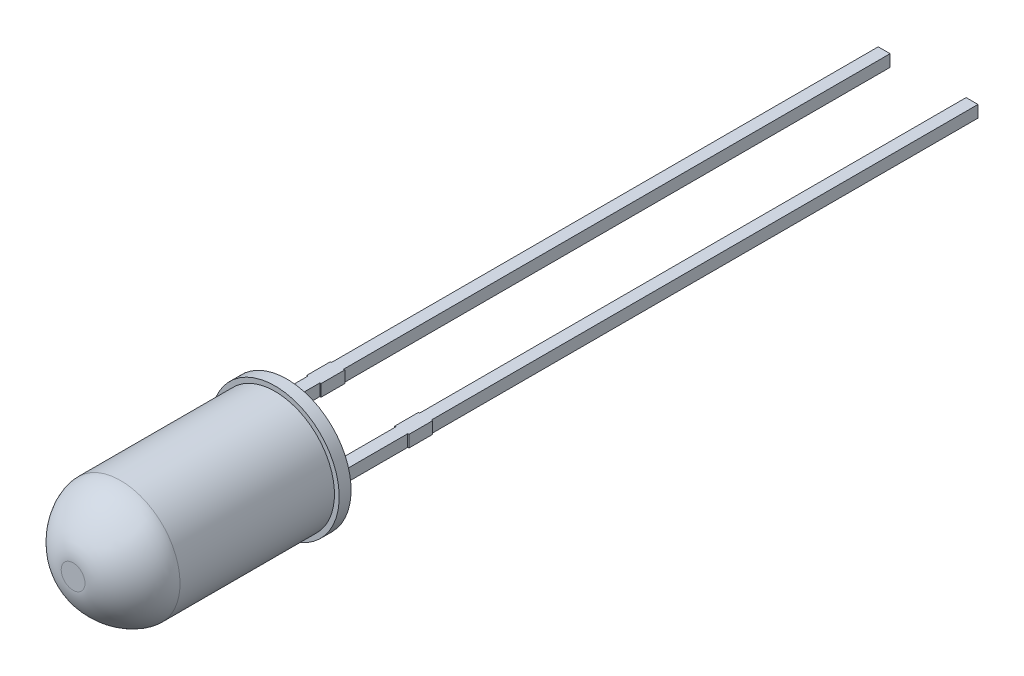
ISO-10303-21;
HEADER;
FILE_DESCRIPTION(('STEP AP214'),'2;1');
FILE_NAME('part.step','',(''),(''),'','','');
FILE_SCHEMA(('AUTOMOTIVE_DESIGN { 1 0 10303 214 1 1 1 1 }'));
ENDSEC;
DATA;
#1=APPLICATION_CONTEXT('core data for automotive mechanical design processes');
#2=APPLICATION_PROTOCOL_DEFINITION('international standard','automotive_design',2000,#1);
#3=PRODUCT_CONTEXT('',#1,'mechanical');
#4=PRODUCT('Part','Part','',(#3));
#5=PRODUCT_RELATED_PRODUCT_CATEGORY('part','',(#4));
#6=PRODUCT_DEFINITION_FORMATION('','',#4);
#7=PRODUCT_DEFINITION_CONTEXT('part definition',#1,'design');
#8=PRODUCT_DEFINITION('design','',#6,#7);
#9=PRODUCT_DEFINITION_SHAPE('','',#8);
#10=(LENGTH_UNIT() NAMED_UNIT(*) SI_UNIT(.MILLI.,.METRE.));
#11=(NAMED_UNIT(*) PLANE_ANGLE_UNIT() SI_UNIT($,.RADIAN.));
#12=(NAMED_UNIT(*) SI_UNIT($,.STERADIAN.) SOLID_ANGLE_UNIT());
#13=UNCERTAINTY_MEASURE_WITH_UNIT(LENGTH_MEASURE(1.E-05),#10,'distance_accuracy_value','');
#14=(GEOMETRIC_REPRESENTATION_CONTEXT(3) GLOBAL_UNCERTAINTY_ASSIGNED_CONTEXT((#13)) GLOBAL_UNIT_ASSIGNED_CONTEXT((#10,
#11,#12)) REPRESENTATION_CONTEXT('',''));
#15=CARTESIAN_POINT('',(0.,0.,0.));
#16=DIRECTION('',(0.,0.,1.));
#17=DIRECTION('',(1.,0.,0.));
#18=AXIS2_PLACEMENT_3D('',#15,#16,#17);
#19=CARTESIAN_POINT('',(-2.16595797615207,-1.41619037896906,-4.));
#20=DIRECTION('',(0.,0.,-1.));
#21=DIRECTION('',(-1.,0.,0.));
#22=AXIS2_PLACEMENT_3D('',#19,#20,#21);
#23=PLANE('',#22);
#24=DIRECTION('',(-1.,0.,0.));
#25=VECTOR('',#24,1.);
#26=CARTESIAN_POINT('',(-2.16595797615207,-0.25,-4.));
#27=LINE('',#26,#25);
#28=CARTESIAN_POINT('',(-1.56595797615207,-0.25,-4.));
#29=VERTEX_POINT('',#28);
#30=CARTESIAN_POINT('',(-1.61595797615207,-0.25,-4.));
#31=VERTEX_POINT('',#30);
#32=EDGE_CURVE('E366',#29,#31,#27,.T.);
#33=ORIENTED_EDGE('',*,*,#32,.T.);
#34=DIRECTION('',(0.,1.,0.));
#35=VECTOR('',#34,1.);
#36=CARTESIAN_POINT('',(-1.61595797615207,-1.41619037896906,-4.));
#37=LINE('',#36,#35);
#38=CARTESIAN_POINT('',(-1.61595797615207,0.25,-4.));
#39=VERTEX_POINT('',#38);
#40=EDGE_CURVE('E12',#31,#39,#37,.T.);
#41=ORIENTED_EDGE('',*,*,#40,.T.);
#42=DIRECTION('',(-1.,0.,0.));
#43=VECTOR('',#42,1.);
#44=CARTESIAN_POINT('',(-2.16595797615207,0.25,-4.));
#45=LINE('',#44,#43);
#46=CARTESIAN_POINT('',(-1.56595797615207,0.25,-4.));
#47=VERTEX_POINT('',#46);
#48=EDGE_CURVE('E406',#47,#39,#45,.T.);
#49=ORIENTED_EDGE('',*,*,#48,.F.);
#50=DIRECTION('',(0.,1.,0.));
#51=VECTOR('',#50,1.);
#52=CARTESIAN_POINT('',(-1.56595797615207,-1.41619037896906,-4.));
#53=LINE('',#52,#51);
#54=EDGE_CURVE('E378',#29,#47,#53,.T.);
#55=ORIENTED_EDGE('',*,*,#54,.F.);
#56=EDGE_LOOP('',(#33,#41,#49,#55));
#57=FACE_BOUND('',#56,.T.);
#58=ADVANCED_FACE('F43',(#57),#23,.T.);
#59=CARTESIAN_POINT('',(-2.11595797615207,0.25,-4.));
#60=VERTEX_POINT('',#59);
#61=CARTESIAN_POINT('',(-2.16595797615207,0.25,-4.));
#62=VERTEX_POINT('',#61);
#63=EDGE_CURVE('E295',#60,#62,#45,.T.);
#64=ORIENTED_EDGE('',*,*,#63,.F.);
#65=DIRECTION('',(0.,-1.,0.));
#66=VECTOR('',#65,1.);
#67=CARTESIAN_POINT('',(-2.11595797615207,-1.41619037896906,-4.));
#68=LINE('',#67,#66);
#69=CARTESIAN_POINT('',(-2.11595797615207,-0.25,-4.));
#70=VERTEX_POINT('',#69);
#71=EDGE_CURVE('E55',#60,#70,#68,.T.);
#72=ORIENTED_EDGE('',*,*,#71,.T.);
#73=CARTESIAN_POINT('',(-2.16595797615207,-0.25,-4.));
#74=VERTEX_POINT('',#73);
#75=EDGE_CURVE('E360',#70,#74,#27,.T.);
#76=ORIENTED_EDGE('',*,*,#75,.T.);
#77=DIRECTION('',(0.,1.,0.));
#78=VECTOR('',#77,1.);
#79=CARTESIAN_POINT('',(-2.16595797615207,-1.41619037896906,-4.));
#80=LINE('',#79,#78);
#81=EDGE_CURVE('E369',#74,#62,#80,.T.);
#82=ORIENTED_EDGE('',*,*,#81,.T.);
#83=EDGE_LOOP('',(#64,#72,#76,#82));
#84=FACE_BOUND('',#83,.T.);
#85=ADVANCED_FACE('F358',(#84),#23,.T.);
#86=CARTESIAN_POINT('',(1.53404202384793,-1.41619037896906,-4.00000000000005));
#87=DIRECTION('',(0.,0.,-1.));
#88=DIRECTION('',(-1.,0.,0.));
#89=AXIS2_PLACEMENT_3D('',#86,#87,#88);
#90=PLANE('',#89);
#91=DIRECTION('',(-1.,0.,0.));
#92=VECTOR('',#91,1.);
#93=CARTESIAN_POINT('',(1.53404202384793,-0.250000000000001,-4.00000000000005));
#94=LINE('',#93,#92);
#95=CARTESIAN_POINT('',(2.13404202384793,-0.250000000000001,-4.00000000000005));
#96=VERTEX_POINT('',#95);
#97=CARTESIAN_POINT('',(2.08404202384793,-0.25,-4.00000000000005));
#98=VERTEX_POINT('',#97);
#99=EDGE_CURVE('E289',#96,#98,#94,.T.);
#100=ORIENTED_EDGE('',*,*,#99,.T.);
#101=DIRECTION('',(0.,1.,0.));
#102=VECTOR('',#101,1.);
#103=CARTESIAN_POINT('',(2.08404202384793,-1.41619037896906,-4.00000000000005));
#104=LINE('',#103,#102);
#105=CARTESIAN_POINT('',(2.08404202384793,0.25,-4.00000000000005));
#106=VERTEX_POINT('',#105);
#107=EDGE_CURVE('E316',#98,#106,#104,.T.);
#108=ORIENTED_EDGE('',*,*,#107,.T.);
#109=DIRECTION('',(-1.,0.,0.));
#110=VECTOR('',#109,1.);
#111=CARTESIAN_POINT('',(1.53404202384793,0.25,-4.00000000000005));
#112=LINE('',#111,#110);
#113=CARTESIAN_POINT('',(2.13404202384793,0.25,-4.00000000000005));
#114=VERTEX_POINT('',#113);
#115=EDGE_CURVE('E303',#114,#106,#112,.T.);
#116=ORIENTED_EDGE('',*,*,#115,.F.);
#117=DIRECTION('',(0.,1.,0.));
#118=VECTOR('',#117,1.);
#119=CARTESIAN_POINT('',(2.13404202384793,-1.41619037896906,-4.00000000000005));
#120=LINE('',#119,#118);
#121=EDGE_CURVE('E279',#96,#114,#120,.T.);
#122=ORIENTED_EDGE('',*,*,#121,.F.);
#123=EDGE_LOOP('',(#100,#108,#116,#122));
#124=FACE_BOUND('',#123,.T.);
#125=ADVANCED_FACE('F554',(#124),#90,.T.);
#126=CARTESIAN_POINT('',(1.58404202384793,0.25,-4.00000000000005));
#127=VERTEX_POINT('',#126);
#128=CARTESIAN_POINT('',(1.53404202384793,0.25,-4.00000000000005));
#129=VERTEX_POINT('',#128);
#130=EDGE_CURVE('E251',#127,#129,#112,.T.);
#131=ORIENTED_EDGE('',*,*,#130,.F.);
#132=DIRECTION('',(0.,-1.,0.));
#133=VECTOR('',#132,1.);
#134=CARTESIAN_POINT('',(1.58404202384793,-1.41619037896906,-4.00000000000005));
#135=LINE('',#134,#133);
#136=CARTESIAN_POINT('',(1.58404202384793,-0.25,-4.00000000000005));
#137=VERTEX_POINT('',#136);
#138=EDGE_CURVE('E312',#127,#137,#135,.T.);
#139=ORIENTED_EDGE('',*,*,#138,.T.);
#140=CARTESIAN_POINT('',(1.53404202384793,-0.250000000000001,-4.00000000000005));
#141=VERTEX_POINT('',#140);
#142=EDGE_CURVE('E282',#137,#141,#94,.T.);
#143=ORIENTED_EDGE('',*,*,#142,.T.);
#144=DIRECTION('',(0.,1.,0.));
#145=VECTOR('',#144,1.);
#146=CARTESIAN_POINT('',(1.53404202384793,-1.41619037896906,-4.00000000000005));
#147=LINE('',#146,#145);
#148=EDGE_CURVE('E286',#141,#129,#147,.T.);
#149=ORIENTED_EDGE('',*,*,#148,.T.);
#150=EDGE_LOOP('',(#131,#139,#143,#149));
#151=FACE_BOUND('',#150,.T.);
#152=ADVANCED_FACE('F311',(#151),#90,.T.);
#153=CARTESIAN_POINT('',(0.,0.,9.));
#154=DIRECTION('',(0.,0.,-1.));
#155=DIRECTION('',(-1.,0.,0.));
#156=AXIS2_PLACEMENT_3D('',#153,#154,#155);
#157=CYLINDRICAL_SURFACE('',#156,2.5);
#158=CARTESIAN_POINT('',(2.5,0.,7.));
#159=CARTESIAN_POINT('',(2.5,0.327249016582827,7.));
#160=CARTESIAN_POINT('',(2.43493160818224,0.654369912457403,7.));
#161=CARTESIAN_POINT('',(2.1844660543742,1.25904724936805,7.));
#162=CARTESIAN_POINT('',(1.99916695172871,1.53636695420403,7.));
#163=CARTESIAN_POINT('',(1.53636695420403,1.99916695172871,7.));
#164=CARTESIAN_POINT('',(1.25904724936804,2.1844660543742,7.));
#165=CARTESIAN_POINT('',(0.654369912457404,2.43493160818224,7.));
#166=CARTESIAN_POINT('',(0.327249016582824,2.5,7.));
#167=CARTESIAN_POINT('',(-0.327249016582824,2.5,7.));
#168=CARTESIAN_POINT('',(-0.654369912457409,2.43493160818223,7.));
#169=CARTESIAN_POINT('',(-1.25904724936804,2.1844660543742,7.));
#170=CARTESIAN_POINT('',(-1.53636695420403,1.99916695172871,7.));
#171=CARTESIAN_POINT('',(-1.99916695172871,1.53636695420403,7.));
#172=CARTESIAN_POINT('',(-2.1844660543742,1.25904724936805,7.));
#173=CARTESIAN_POINT('',(-2.43493160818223,0.65436991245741,7.));
#174=CARTESIAN_POINT('',(-2.5,0.327249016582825,7.));
#175=CARTESIAN_POINT('',(-2.5,-0.327249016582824,7.));
#176=CARTESIAN_POINT('',(-2.43493160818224,-0.654369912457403,7.));
#177=CARTESIAN_POINT('',(-2.1844660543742,-1.25904724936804,7.));
#178=CARTESIAN_POINT('',(-1.99916695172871,-1.53636695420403,7.));
#179=CARTESIAN_POINT('',(-1.53636695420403,-1.99916695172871,7.));
#180=CARTESIAN_POINT('',(-1.25904724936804,-2.1844660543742,7.));
#181=CARTESIAN_POINT('',(-0.654369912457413,-2.43493160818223,7.));
#182=CARTESIAN_POINT('',(-0.327249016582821,-2.5,7.));
#183=CARTESIAN_POINT('',(0.327249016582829,-2.5,7.));
#184=CARTESIAN_POINT('',(0.654369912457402,-2.43493160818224,7.));
#185=CARTESIAN_POINT('',(1.25904724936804,-2.18446605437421,7.));
#186=CARTESIAN_POINT('',(1.53636695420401,-1.99916695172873,7.));
#187=CARTESIAN_POINT('',(1.99916695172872,-1.53636695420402,7.));
#188=CARTESIAN_POINT('',(2.1844660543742,-1.25904724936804,7.));
#189=CARTESIAN_POINT('',(2.43493160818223,-0.654369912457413,7.));
#190=CARTESIAN_POINT('',(2.5,-0.327249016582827,7.));
#191=CARTESIAN_POINT('',(2.5,0.,7.));
#192=(BOUNDED_CURVE() B_SPLINE_CURVE(3,(#158,#159,#160,#161,#162,#163,#164,#165,#166,#167,#168,
#169,#170,#171,#172,#173,#174,#175,#176,#177,#178,#179,#180,#181,#182,#183,#184,#185,#186,#187,
#188,#189,#190,#191),.UNSPECIFIED.,.T.,.F.) B_SPLINE_CURVE_WITH_KNOTS((4,2,2,2,2,2,2,2,2,2,2,2,
2,2,2,2,4),(0.,0.392699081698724,0.785398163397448,1.17809724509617,1.5707963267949,
1.96349540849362,2.35619449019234,2.74889357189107,3.14159265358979,3.53429173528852,
3.92699081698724,4.31968989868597,4.71238898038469,5.10508806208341,5.49778714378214,
5.89048622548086,6.28318530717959),
.UNSPECIFIED.) CURVE() GEOMETRIC_REPRESENTATION_ITEM() RATIONAL_B_SPLINE_CURVE((1.,1.,1.,1.,1.,
1.,1.,1.,1.,1.,1.,1.,1.,1.,1.,1.,1.,1.,1.,1.,1.,1.,1.,1.,1.,1.,1.,1.,1.,1.,1.,1.,1.,1.)) REPRESENTATION_ITEM(''));
#193=CARTESIAN_POINT('',(2.5,0.,7.));
#194=VERTEX_POINT('',#193);
#195=EDGE_CURVE('E523',#194,#194,#192,.F.);
#196=ORIENTED_EDGE('',*,*,#195,.T.);
#197=EDGE_LOOP('',(#196));
#198=FACE_BOUND('',#197,.T.);
#199=CARTESIAN_POINT('',(0.,0.,0.5));
#200=DIRECTION('',(0.,0.,-1.));
#201=DIRECTION('',(-1.,0.,0.));
#202=AXIS2_PLACEMENT_3D('',#199,#200,#201);
#203=CIRCLE('',#202,2.5);
#204=CARTESIAN_POINT('',(-2.5,0.,0.5));
#205=VERTEX_POINT('',#204);
#206=EDGE_CURVE('E317',#205,#205,#203,.T.);
#207=ORIENTED_EDGE('',*,*,#206,.F.);
#208=EDGE_LOOP('',(#207));
#209=FACE_BOUND('',#208,.T.);
#210=ADVANCED_FACE('F491',(#198,#209),#157,.T.);
#211=CARTESIAN_POINT('',(0.,0.,9.));
#212=DIRECTION('',(0.,0.,1.));
#213=DIRECTION('',(1.,0.,0.));
#214=AXIS2_PLACEMENT_3D('',#211,#212,#213);
#215=PLANE('',#214);
#216=CARTESIAN_POINT('',(0.500000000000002,0.,9.));
#217=CARTESIAN_POINT('',(0.50000001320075,-0.00818104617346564,9.));
#218=CARTESIAN_POINT('',(0.49979667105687,-0.0163619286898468,9.));
#219=CARTESIAN_POINT('',(0.498987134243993,-0.0327036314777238,9.));
#220=CARTESIAN_POINT('',(0.498380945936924,-0.040864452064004,9.));
#221=CARTESIAN_POINT('',(0.496769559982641,-0.0571467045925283,9.));
#222=CARTESIAN_POINT('',(0.495764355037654,-0.0652681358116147,9.));
#223=CARTESIAN_POINT('',(0.493358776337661,-0.0814523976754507,9.));
#224=CARTESIAN_POINT('',(0.491958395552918,-0.0895152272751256,9.));
#225=CARTESIAN_POINT('',(0.488766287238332,-0.105563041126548,9.));
#226=CARTESIAN_POINT('',(0.486974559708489,-0.113548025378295,9.));
#227=CARTESIAN_POINT('',(0.48300357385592,-0.129420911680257,9.));
#228=CARTESIAN_POINT('',(0.480824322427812,-0.137308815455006,9.));
#229=CARTESIAN_POINT('',(0.476082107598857,-0.152968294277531,9.));
#230=CARTESIAN_POINT('',(0.473519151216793,-0.160739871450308,9.));
#231=CARTESIAN_POINT('',(0.46801334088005,-0.176147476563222,9.));
#232=CARTESIAN_POINT('',(0.465070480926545,-0.183783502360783,9.));
#233=CARTESIAN_POINT('',(0.458809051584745,-0.19889993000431,9.));
#234=CARTESIAN_POINT('',(0.455490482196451,-0.206380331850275,9.));
#235=CARTESIAN_POINT('',(0.448488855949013,-0.221168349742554,9.));
#236=CARTESIAN_POINT('',(0.444805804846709,-0.228475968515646,9.));
#237=CARTESIAN_POINT('',(0.437086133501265,-0.242902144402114,9.));
#238=CARTESIAN_POINT('',(0.433049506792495,-0.250020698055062,9.));
#239=CARTESIAN_POINT('',(0.424633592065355,-0.264052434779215,9.));
#240=CARTESIAN_POINT('',(0.420254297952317,-0.270965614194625,9.));
#241=CARTESIAN_POINT('',(0.411163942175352,-0.284570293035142,9.));
#242=CARTESIAN_POINT('',(0.406452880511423,-0.291261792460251,9.));
#243=CARTESIAN_POINT('',(0.39670987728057,-0.304406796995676,9.));
#244=CARTESIAN_POINT('',(0.391677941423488,-0.310860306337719,9.));
#245=CARTESIAN_POINT('',(0.38130408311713,-0.323513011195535,9.));
#246=CARTESIAN_POINT('',(0.37596216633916,-0.329712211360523,9.));
#247=CARTESIAN_POINT('',(0.364979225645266,-0.34183999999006,9.));
#248=CARTESIAN_POINT('',(0.359338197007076,-0.347768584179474,9.));
#249=CARTESIAN_POINT('',(0.347768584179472,-0.359338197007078,9.));
#250=CARTESIAN_POINT('',(0.341839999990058,-0.364979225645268,9.));
#251=CARTESIAN_POINT('',(0.329712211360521,-0.375962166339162,9.));
#252=CARTESIAN_POINT('',(0.323513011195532,-0.381304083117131,9.));
#253=CARTESIAN_POINT('',(0.310860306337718,-0.39167794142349,9.));
#254=CARTESIAN_POINT('',(0.304406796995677,-0.396709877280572,9.));
#255=CARTESIAN_POINT('',(0.291261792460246,-0.406452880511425,9.));
#256=CARTESIAN_POINT('',(0.284570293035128,-0.411163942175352,9.));
#257=CARTESIAN_POINT('',(0.270965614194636,-0.420254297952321,9.));
#258=CARTESIAN_POINT('',(0.264052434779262,-0.424633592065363,9.));
#259=CARTESIAN_POINT('',(0.250020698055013,-0.43304950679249,9.));
#260=CARTESIAN_POINT('',(0.242902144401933,-0.437086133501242,9.));
#261=CARTESIAN_POINT('',(0.228475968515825,-0.444805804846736,9.));
#262=CARTESIAN_POINT('',(0.221168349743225,-0.448488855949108,9.));
#263=CARTESIAN_POINT('',(0.206380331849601,-0.455490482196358,9.));
#264=CARTESIAN_POINT('',(0.198899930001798,-0.458809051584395,9.));
#265=CARTESIAN_POINT('',(0.183783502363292,-0.465070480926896,9.));
#266=CARTESIAN_POINT('',(0.17614747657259,-0.468013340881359,9.));
#267=CARTESIAN_POINT('',(0.160739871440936,-0.473519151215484,9.));
#268=CARTESIAN_POINT('',(0.15296829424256,-0.476082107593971,9.));
#269=CARTESIAN_POINT('',(0.137308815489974,-0.480824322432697,9.));
#270=CARTESIAN_POINT('',(0.129420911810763,-0.483003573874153,9.));
#271=CARTESIAN_POINT('',(0.113548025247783,-0.486974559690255,9.));
#272=CARTESIAN_POINT('',(0.105563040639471,-0.488766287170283,9.));
#273=CARTESIAN_POINT('',(0.0895152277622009,-0.491958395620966,9.));
#274=CARTESIAN_POINT('',(0.0814523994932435,-0.493358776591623,9.));
#275=CARTESIAN_POINT('',(0.0652681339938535,-0.495764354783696,9.));
#276=CARTESIAN_POINT('',(0.0571466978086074,-0.496769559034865,9.));
#277=CARTESIAN_POINT('',(0.0408644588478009,-0.498380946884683,9.));
#278=CARTESIAN_POINT('',(0.0327036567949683,-0.498987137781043,9.));
#279=CARTESIAN_POINT('',(0.0163619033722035,-0.499796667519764,9.));
#280=CARTESIAN_POINT('',(0.00818095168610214,-0.500000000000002,9.));
#281=CARTESIAN_POINT('',(-0.0081809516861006,-0.500000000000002,9.));
#282=CARTESIAN_POINT('',(-0.016361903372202,-0.499796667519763,9.));
#283=CARTESIAN_POINT('',(-0.032703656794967,-0.498987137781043,9.));
#284=CARTESIAN_POINT('',(-0.0408644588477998,-0.498380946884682,9.));
#285=CARTESIAN_POINT('',(-0.0571466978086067,-0.496769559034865,9.));
#286=CARTESIAN_POINT('',(-0.0652681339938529,-0.495764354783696,9.));
#287=CARTESIAN_POINT('',(-0.0814523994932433,-0.493358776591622,9.));
#288=CARTESIAN_POINT('',(-0.0895152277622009,-0.491958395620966,9.));
#289=CARTESIAN_POINT('',(-0.105563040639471,-0.488766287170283,9.));
#290=CARTESIAN_POINT('',(-0.113548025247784,-0.486974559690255,9.));
#291=CARTESIAN_POINT('',(-0.129420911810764,-0.483003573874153,9.));
#292=CARTESIAN_POINT('',(-0.137308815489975,-0.480824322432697,9.));
#293=CARTESIAN_POINT('',(-0.152968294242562,-0.476082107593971,9.));
#294=CARTESIAN_POINT('',(-0.160739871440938,-0.473519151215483,9.));
#295=CARTESIAN_POINT('',(-0.176147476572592,-0.468013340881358,9.));
#296=CARTESIAN_POINT('',(-0.183783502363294,-0.465070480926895,9.));
#297=CARTESIAN_POINT('',(-0.198899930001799,-0.458809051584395,9.));
#298=CARTESIAN_POINT('',(-0.206380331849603,-0.455490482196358,9.));
#299=CARTESIAN_POINT('',(-0.221168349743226,-0.448488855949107,9.));
#300=CARTESIAN_POINT('',(-0.228475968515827,-0.444805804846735,9.));
#301=CARTESIAN_POINT('',(-0.242902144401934,-0.437086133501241,9.));
#302=CARTESIAN_POINT('',(-0.250020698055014,-0.433049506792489,9.));
#303=CARTESIAN_POINT('',(-0.264052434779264,-0.424633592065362,9.));
#304=CARTESIAN_POINT('',(-0.270965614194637,-0.42025429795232,9.));
#305=CARTESIAN_POINT('',(-0.284570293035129,-0.41116394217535,9.));
#306=CARTESIAN_POINT('',(-0.291261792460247,-0.406452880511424,9.));
#307=CARTESIAN_POINT('',(-0.304406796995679,-0.396709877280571,9.));
#308=CARTESIAN_POINT('',(-0.310860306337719,-0.391677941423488,9.));
#309=CARTESIAN_POINT('',(-0.323513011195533,-0.38130408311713,9.));
#310=CARTESIAN_POINT('',(-0.329712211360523,-0.375962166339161,9.));
#311=CARTESIAN_POINT('',(-0.341839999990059,-0.364979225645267,9.));
#312=CARTESIAN_POINT('',(-0.347768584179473,-0.359338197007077,9.));
#313=CARTESIAN_POINT('',(-0.359338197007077,-0.347768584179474,9.));
#314=CARTESIAN_POINT('',(-0.364979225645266,-0.34183999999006,9.));
#315=CARTESIAN_POINT('',(-0.375962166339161,-0.329712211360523,9.));
#316=CARTESIAN_POINT('',(-0.38130408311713,-0.323513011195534,9.));
#317=CARTESIAN_POINT('',(-0.391677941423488,-0.310860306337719,9.));
#318=CARTESIAN_POINT('',(-0.39670987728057,-0.304406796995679,9.));
#319=CARTESIAN_POINT('',(-0.406452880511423,-0.291261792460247,9.));
#320=CARTESIAN_POINT('',(-0.41116394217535,-0.284570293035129,9.));
#321=CARTESIAN_POINT('',(-0.42025429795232,-0.270965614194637,9.));
#322=CARTESIAN_POINT('',(-0.424633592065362,-0.264052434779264,9.));
#323=CARTESIAN_POINT('',(-0.433049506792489,-0.250020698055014,9.));
#324=CARTESIAN_POINT('',(-0.437086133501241,-0.242902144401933,9.));
#325=CARTESIAN_POINT('',(-0.444805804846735,-0.228475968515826,9.));
#326=CARTESIAN_POINT('',(-0.448488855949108,-0.221168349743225,9.));
#327=CARTESIAN_POINT('',(-0.455490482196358,-0.206380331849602,9.));
#328=CARTESIAN_POINT('',(-0.458809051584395,-0.198899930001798,9.));
#329=CARTESIAN_POINT('',(-0.465070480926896,-0.183783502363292,9.));
#330=CARTESIAN_POINT('',(-0.468013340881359,-0.17614747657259,9.));
#331=CARTESIAN_POINT('',(-0.473519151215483,-0.160739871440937,9.));
#332=CARTESIAN_POINT('',(-0.476082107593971,-0.152968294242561,9.));
#333=CARTESIAN_POINT('',(-0.480824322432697,-0.137308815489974,9.));
#334=CARTESIAN_POINT('',(-0.483003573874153,-0.129420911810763,9.));
#335=CARTESIAN_POINT('',(-0.486974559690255,-0.113548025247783,9.));
#336=CARTESIAN_POINT('',(-0.488766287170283,-0.105563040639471,9.));
#337=CARTESIAN_POINT('',(-0.491958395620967,-0.0895152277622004,9.));
#338=CARTESIAN_POINT('',(-0.493358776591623,-0.0814523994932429,9.));
#339=CARTESIAN_POINT('',(-0.495764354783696,-0.0652681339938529,9.));
#340=CARTESIAN_POINT('',(-0.496769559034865,-0.0571466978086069,9.));
#341=CARTESIAN_POINT('',(-0.498380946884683,-0.0408644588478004,9.));
#342=CARTESIAN_POINT('',(-0.498987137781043,-0.0327036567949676,9.));
#343=CARTESIAN_POINT('',(-0.499796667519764,-0.0163619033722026,9.));
#344=CARTESIAN_POINT('',(-0.500000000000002,-0.00818095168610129,9.));
#345=CARTESIAN_POINT('',(-0.500000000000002,0.00818095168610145,9.));
#346=CARTESIAN_POINT('',(-0.499796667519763,0.0163619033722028,9.));
#347=CARTESIAN_POINT('',(-0.498987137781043,0.0327036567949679,9.));
#348=CARTESIAN_POINT('',(-0.498380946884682,0.0408644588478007,9.));
#349=CARTESIAN_POINT('',(-0.496769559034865,0.0571466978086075,9.));
#350=CARTESIAN_POINT('',(-0.495764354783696,0.0652681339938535,9.));
#351=CARTESIAN_POINT('',(-0.493358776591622,0.0814523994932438,9.));
#352=CARTESIAN_POINT('',(-0.491958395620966,0.0895152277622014,9.));
#353=CARTESIAN_POINT('',(-0.488766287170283,0.105563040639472,9.));
#354=CARTESIAN_POINT('',(-0.486974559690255,0.113548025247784,9.));
#355=CARTESIAN_POINT('',(-0.483003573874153,0.129420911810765,9.));
#356=CARTESIAN_POINT('',(-0.480824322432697,0.137308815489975,9.));
#357=CARTESIAN_POINT('',(-0.476082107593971,0.152968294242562,9.));
#358=CARTESIAN_POINT('',(-0.473519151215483,0.160739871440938,9.));
#359=CARTESIAN_POINT('',(-0.468013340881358,0.176147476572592,9.));
#360=CARTESIAN_POINT('',(-0.465070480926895,0.183783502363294,9.));
#361=CARTESIAN_POINT('',(-0.458809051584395,0.198899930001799,9.));
#362=CARTESIAN_POINT('',(-0.455490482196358,0.206380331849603,9.));
#363=CARTESIAN_POINT('',(-0.448488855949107,0.221168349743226,9.));
#364=CARTESIAN_POINT('',(-0.444805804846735,0.228475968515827,9.));
#365=CARTESIAN_POINT('',(-0.437086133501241,0.242902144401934,9.));
#366=CARTESIAN_POINT('',(-0.433049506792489,0.250020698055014,9.));
#367=CARTESIAN_POINT('',(-0.424633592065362,0.264052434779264,9.));
#368=CARTESIAN_POINT('',(-0.42025429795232,0.270965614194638,9.));
#369=CARTESIAN_POINT('',(-0.41116394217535,0.284570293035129,9.));
#370=CARTESIAN_POINT('',(-0.406452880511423,0.291261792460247,9.));
#371=CARTESIAN_POINT('',(-0.396709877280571,0.304406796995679,9.));
#372=CARTESIAN_POINT('',(-0.391677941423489,0.310860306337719,9.));
#373=CARTESIAN_POINT('',(-0.38130408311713,0.323513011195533,9.));
#374=CARTESIAN_POINT('',(-0.375962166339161,0.329712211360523,9.));
#375=CARTESIAN_POINT('',(-0.364979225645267,0.341839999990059,9.));
#376=CARTESIAN_POINT('',(-0.359338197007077,0.347768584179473,9.));
#377=CARTESIAN_POINT('',(-0.347768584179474,0.359338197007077,9.));
#378=CARTESIAN_POINT('',(-0.34183999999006,0.364979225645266,9.));
#379=CARTESIAN_POINT('',(-0.329712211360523,0.375962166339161,9.));
#380=CARTESIAN_POINT('',(-0.323513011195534,0.38130408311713,9.));
#381=CARTESIAN_POINT('',(-0.31086030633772,0.391677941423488,9.));
#382=CARTESIAN_POINT('',(-0.30440679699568,0.39670987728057,9.));
#383=CARTESIAN_POINT('',(-0.291261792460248,0.406452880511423,9.));
#384=CARTESIAN_POINT('',(-0.28457029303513,0.41116394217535,9.));
#385=CARTESIAN_POINT('',(-0.270965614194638,0.420254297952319,9.));
#386=CARTESIAN_POINT('',(-0.264052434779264,0.424633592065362,9.));
#387=CARTESIAN_POINT('',(-0.250020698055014,0.433049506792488,9.));
#388=CARTESIAN_POINT('',(-0.242902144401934,0.43708613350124,9.));
#389=CARTESIAN_POINT('',(-0.228475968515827,0.444805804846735,9.));
#390=CARTESIAN_POINT('',(-0.221168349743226,0.448488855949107,9.));
#391=CARTESIAN_POINT('',(-0.206380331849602,0.455490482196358,9.));
#392=CARTESIAN_POINT('',(-0.198899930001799,0.458809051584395,9.));
#393=CARTESIAN_POINT('',(-0.183783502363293,0.465070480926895,9.));
#394=CARTESIAN_POINT('',(-0.176147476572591,0.468013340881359,9.));
#395=CARTESIAN_POINT('',(-0.160739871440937,0.473519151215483,9.));
#396=CARTESIAN_POINT('',(-0.152968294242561,0.476082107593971,9.));
#397=CARTESIAN_POINT('',(-0.137308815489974,0.480824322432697,9.));
#398=CARTESIAN_POINT('',(-0.129420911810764,0.483003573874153,9.));
#399=CARTESIAN_POINT('',(-0.113548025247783,0.486974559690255,9.));
#400=CARTESIAN_POINT('',(-0.105563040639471,0.488766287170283,9.));
#401=CARTESIAN_POINT('',(-0.0895152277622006,0.491958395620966,9.));
#402=CARTESIAN_POINT('',(-0.0814523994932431,0.493358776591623,9.));
#403=CARTESIAN_POINT('',(-0.065268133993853,0.495764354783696,9.));
#404=CARTESIAN_POINT('',(-0.057146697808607,0.496769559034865,9.));
#405=CARTESIAN_POINT('',(-0.0408644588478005,0.498380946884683,9.));
#406=CARTESIAN_POINT('',(-0.0327036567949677,0.498987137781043,9.));
#407=CARTESIAN_POINT('',(-0.0163619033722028,0.499796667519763,9.));
#408=CARTESIAN_POINT('',(-0.00818095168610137,0.500000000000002,9.));
#409=CARTESIAN_POINT('',(0.00818095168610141,0.500000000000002,9.));
#410=CARTESIAN_POINT('',(0.0163619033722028,0.499796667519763,9.));
#411=CARTESIAN_POINT('',(0.0327036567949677,0.498987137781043,9.));
#412=CARTESIAN_POINT('',(0.0408644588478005,0.498380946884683,9.));
#413=CARTESIAN_POINT('',(0.057146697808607,0.496769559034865,9.));
#414=CARTESIAN_POINT('',(0.065268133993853,0.495764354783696,9.));
#415=CARTESIAN_POINT('',(0.081452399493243,0.493358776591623,9.));
#416=CARTESIAN_POINT('',(0.0895152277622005,0.491958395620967,9.));
#417=CARTESIAN_POINT('',(0.105563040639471,0.488766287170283,9.));
#418=CARTESIAN_POINT('',(0.113548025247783,0.486974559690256,9.));
#419=CARTESIAN_POINT('',(0.129420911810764,0.483003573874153,9.));
#420=CARTESIAN_POINT('',(0.137308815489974,0.480824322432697,9.));
#421=CARTESIAN_POINT('',(0.152968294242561,0.476082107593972,9.));
#422=CARTESIAN_POINT('',(0.160739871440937,0.473519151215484,9.));
#423=CARTESIAN_POINT('',(0.176147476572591,0.468013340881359,9.));
#424=CARTESIAN_POINT('',(0.183783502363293,0.465070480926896,9.));
#425=CARTESIAN_POINT('',(0.198899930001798,0.458809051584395,9.));
#426=CARTESIAN_POINT('',(0.206380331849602,0.455490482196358,9.));
#427=CARTESIAN_POINT('',(0.221168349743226,0.448488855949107,9.));
#428=CARTESIAN_POINT('',(0.228475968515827,0.444805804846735,9.));
#429=CARTESIAN_POINT('',(0.242902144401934,0.437086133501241,9.));
#430=CARTESIAN_POINT('',(0.250020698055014,0.433049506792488,9.));
#431=CARTESIAN_POINT('',(0.264052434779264,0.424633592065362,9.));
#432=CARTESIAN_POINT('',(0.270965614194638,0.420254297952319,9.));
#433=CARTESIAN_POINT('',(0.28457029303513,0.41116394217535,9.));
#434=CARTESIAN_POINT('',(0.291261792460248,0.406452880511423,9.));
#435=CARTESIAN_POINT('',(0.304406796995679,0.396709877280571,9.));
#436=CARTESIAN_POINT('',(0.310860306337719,0.391677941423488,9.));
#437=CARTESIAN_POINT('',(0.323513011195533,0.38130408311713,9.));
#438=CARTESIAN_POINT('',(0.329712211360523,0.375962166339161,9.));
#439=CARTESIAN_POINT('',(0.341839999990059,0.364979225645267,9.));
#440=CARTESIAN_POINT('',(0.347768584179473,0.359338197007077,9.));
#441=CARTESIAN_POINT('',(0.359338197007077,0.347768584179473,9.));
#442=CARTESIAN_POINT('',(0.364979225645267,0.341839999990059,9.));
#443=CARTESIAN_POINT('',(0.375962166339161,0.329712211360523,9.));
#444=CARTESIAN_POINT('',(0.38130408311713,0.323513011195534,9.));
#445=CARTESIAN_POINT('',(0.391677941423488,0.310860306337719,9.));
#446=CARTESIAN_POINT('',(0.39670987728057,0.304406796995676,9.));
#447=CARTESIAN_POINT('',(0.406452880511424,0.291261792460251,9.));
#448=CARTESIAN_POINT('',(0.411163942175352,0.284570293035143,9.));
#449=CARTESIAN_POINT('',(0.420254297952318,0.270965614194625,9.));
#450=CARTESIAN_POINT('',(0.424633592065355,0.264052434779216,9.));
#451=CARTESIAN_POINT('',(0.433049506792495,0.250020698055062,9.));
#452=CARTESIAN_POINT('',(0.437086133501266,0.242902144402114,9.));
#453=CARTESIAN_POINT('',(0.44480580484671,0.228475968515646,9.));
#454=CARTESIAN_POINT('',(0.448488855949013,0.221168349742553,9.));
#455=CARTESIAN_POINT('',(0.455490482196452,0.206380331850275,9.));
#456=CARTESIAN_POINT('',(0.458809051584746,0.198899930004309,9.));
#457=CARTESIAN_POINT('',(0.465070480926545,0.183783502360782,9.));
#458=CARTESIAN_POINT('',(0.46801334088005,0.176147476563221,9.));
#459=CARTESIAN_POINT('',(0.473519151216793,0.160739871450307,9.));
#460=CARTESIAN_POINT('',(0.476082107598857,0.15296829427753,9.));
#461=CARTESIAN_POINT('',(0.480824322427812,0.137308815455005,9.));
#462=CARTESIAN_POINT('',(0.48300357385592,0.129420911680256,9.));
#463=CARTESIAN_POINT('',(0.486974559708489,0.113548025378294,9.));
#464=CARTESIAN_POINT('',(0.488766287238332,0.105563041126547,9.));
#465=CARTESIAN_POINT('',(0.491958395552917,0.0895152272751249,9.));
#466=CARTESIAN_POINT('',(0.49335877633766,0.08145239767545,9.));
#467=CARTESIAN_POINT('',(0.495764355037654,0.0652681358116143,9.));
#468=CARTESIAN_POINT('',(0.49676955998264,0.057146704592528,9.));
#469=CARTESIAN_POINT('',(0.498380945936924,0.040864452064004,9.));
#470=CARTESIAN_POINT('',(0.498987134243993,0.0327036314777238,9.));
#471=CARTESIAN_POINT('',(0.49979667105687,0.0163619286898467,9.));
#472=CARTESIAN_POINT('',(0.50000001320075,0.00818104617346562,9.));
#473=CARTESIAN_POINT('',(0.500000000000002,0.,9.));
#474=B_SPLINE_CURVE_WITH_KNOTS('',3,(#216,#217,#218,#219,#220,#221,#222,#223,#224,#225,#226,
#227,#228,#229,#230,#231,#232,#233,#234,#235,#236,#237,#238,#239,#240,#241,#242,#243,#244,#245,
#246,#247,#248,#249,#250,#251,#252,#253,#254,#255,#256,#257,#258,#259,#260,#261,#262,#263,#264,
#265,#266,#267,#268,#269,#270,#271,#272,#273,#274,#275,#276,#277,#278,#279,#280,#281,#282,#283,
#284,#285,#286,#287,#288,#289,#290,#291,#292,#293,#294,#295,#296,#297,#298,#299,#300,#301,#302,
#303,#304,#305,#306,#307,#308,#309,#310,#311,#312,#313,#314,#315,#316,#317,#318,#319,#320,#321,
#322,#323,#324,#325,#326,#327,#328,#329,#330,#331,#332,#333,#334,#335,#336,#337,#338,#339,#340,
#341,#342,#343,#344,#345,#346,#347,#348,#349,#350,#351,#352,#353,#354,#355,#356,#357,#358,#359,
#360,#361,#362,#363,#364,#365,#366,#367,#368,#369,#370,#371,#372,#373,#374,#375,#376,#377,#378,
#379,#380,#381,#382,#383,#384,#385,#386,#387,#388,#389,#390,#391,#392,#393,#394,#395,#396,#397,
#398,#399,#400,#401,#402,#403,#404,#405,#406,#407,#408,#409,#410,#411,#412,#413,#414,#415,#416,
#417,#418,#419,#420,#421,#422,#423,#424,#425,#426,#427,#428,#429,#430,#431,#432,#433,#434,#435,
#436,#437,#438,#439,#440,#441,#442,#443,#444,#445,#446,#447,#448,#449,#450,#451,#452,#453,#454,
#455,#456,#457,#458,#459,#460,#461,#462,#463,#464,#465,#466,#467,#468,#469,#470,#471,#472,#473),
.UNSPECIFIED.,.F.,.F.,(4,2,2,2,2,2,2,2,2,2,2,2,2,2,2,2,2,2,2,2,2,2,2,2,2,2,2,2,2,2,2,2,2,2,2,2,
2,2,2,2,2,2,2,2,2,2,2,2,2,2,2,2,2,2,2,2,2,2,2,2,2,2,2,2,2,2,2,2,2,2,2,2,2,2,2,2,2,2,2,2,2,2,2,2,
2,2,2,2,2,2,2,2,2,2,2,2,2,2,2,2,2,2,2,2,2,2,2,2,2,2,2,2,2,2,2,2,2,2,2,2,2,2,2,2,2,2,2,2,4),(0.,
0.0245403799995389,0.0490803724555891,0.0736208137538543,0.0981616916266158,0.122702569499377,
0.147243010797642,0.171783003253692,0.196323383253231,0.220863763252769,0.245403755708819,
0.269944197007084,0.294485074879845,0.319025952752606,0.343566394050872,0.368106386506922,
0.392646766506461,0.417187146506,0.441727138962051,0.466267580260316,0.490808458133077,
0.515349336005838,0.539889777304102,0.564429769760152,0.588970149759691,0.613510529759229,
0.638050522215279,0.662590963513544,0.687131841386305,0.711672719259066,0.73621316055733,
0.76075315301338,0.785293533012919,0.809833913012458,0.834373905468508,0.858914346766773,
0.883455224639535,0.907996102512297,0.932536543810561,0.957076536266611,0.98161691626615,
1.00615729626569,1.03069728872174,1.05523773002,1.07977860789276,1.10431948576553,
1.12885992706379,1.15339991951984,1.17794029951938,1.20248067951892,1.22702067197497,
1.25156111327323,1.27610199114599,1.30064286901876,1.32518331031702,1.34972330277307,
1.37426368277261,1.39880406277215,1.4233440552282,1.44788449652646,1.47242537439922,
1.49696625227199,1.52150669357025,1.5460466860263,1.57058706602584,1.59512744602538,
1.61966743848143,1.64420787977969,1.66874875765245,1.69328963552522,1.71783007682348,
1.74237006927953,1.76691044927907,1.79145082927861,1.81599082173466,1.84053126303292,
1.86507214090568,1.88961301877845,1.91415346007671,1.93869345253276,1.9632338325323,
1.98777421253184,2.01231420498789,2.03685464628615,2.06139552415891,2.08593640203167,
2.11047684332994,2.13501683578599,2.15955721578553,2.18409759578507,2.20863758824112,
2.23317802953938,2.25771890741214,2.2822597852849,2.30680022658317,2.33134021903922,
2.35588059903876,2.3804209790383,2.40496097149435,2.42950141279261,2.45404229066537,
2.47858316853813,2.5031236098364,2.52766360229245,2.55220398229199,2.57674436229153,
2.60128435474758,2.62582479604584,2.6503656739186,2.67490655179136,2.69944699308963,
2.72398698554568,2.74852736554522,2.77306774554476,2.79760773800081,2.82214817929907,
2.84668905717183,2.87122993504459,2.89577037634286,2.92031036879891,2.94485074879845,
2.96939112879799,2.99393112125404,3.0184715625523,3.04301244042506,3.06755331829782,
3.09209375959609,3.11663375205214,3.14117413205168),.UNSPECIFIED.);
#475=CARTESIAN_POINT('',(0.500000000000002,0.,9.));
#476=VERTEX_POINT('',#475);
#477=EDGE_CURVE('E467',#476,#476,#474,.F.);
#478=ORIENTED_EDGE('',*,*,#477,.T.);
#479=EDGE_LOOP('',(#478));
#480=FACE_BOUND('',#479,.T.);
#481=ADVANCED_FACE('F481',(#480),#215,.T.);
#482=CARTESIAN_POINT('',(0.500000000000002,0.,9.));
#483=CARTESIAN_POINT('',(0.500000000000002,0.0654498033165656,9.));
#484=CARTESIAN_POINT('',(0.486986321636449,0.130873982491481,9.));
#485=CARTESIAN_POINT('',(0.436893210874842,0.25180944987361,9.));
#486=CARTESIAN_POINT('',(0.399833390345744,0.307273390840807,9.));
#487=CARTESIAN_POINT('',(0.307273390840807,0.399833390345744,9.));
#488=CARTESIAN_POINT('',(0.25180944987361,0.436893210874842,9.));
#489=CARTESIAN_POINT('',(0.130873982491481,0.486986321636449,9.));
#490=CARTESIAN_POINT('',(0.0654498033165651,0.500000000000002,9.));
#491=CARTESIAN_POINT('',(-0.0654498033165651,0.500000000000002,9.));
#492=CARTESIAN_POINT('',(-0.130873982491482,0.486986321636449,9.));
#493=CARTESIAN_POINT('',(-0.25180944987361,0.436893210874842,9.));
#494=CARTESIAN_POINT('',(-0.307273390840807,0.399833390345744,9.));
#495=CARTESIAN_POINT('',(-0.399833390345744,0.307273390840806,9.));
#496=CARTESIAN_POINT('',(-0.436893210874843,0.251809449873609,9.));
#497=CARTESIAN_POINT('',(-0.486986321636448,0.130873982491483,9.));
#498=CARTESIAN_POINT('',(-0.500000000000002,0.0654498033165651,9.));
#499=CARTESIAN_POINT('',(-0.500000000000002,-0.065449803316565,9.));
#500=CARTESIAN_POINT('',(-0.486986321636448,-0.130873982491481,9.));
#501=CARTESIAN_POINT('',(-0.436893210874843,-0.251809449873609,9.));
#502=CARTESIAN_POINT('',(-0.399833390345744,-0.307273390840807,9.));
#503=CARTESIAN_POINT('',(-0.307273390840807,-0.399833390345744,9.));
#504=CARTESIAN_POINT('',(-0.251809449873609,-0.436893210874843,9.));
#505=CARTESIAN_POINT('',(-0.130873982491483,-0.486986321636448,9.));
#506=CARTESIAN_POINT('',(-0.0654498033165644,-0.500000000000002,9.));
#507=CARTESIAN_POINT('',(0.065449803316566,-0.500000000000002,9.));
#508=CARTESIAN_POINT('',(0.130873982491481,-0.486986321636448,9.));
#509=CARTESIAN_POINT('',(0.251809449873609,-0.436893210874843,9.));
#510=CARTESIAN_POINT('',(0.307273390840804,-0.399833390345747,9.));
#511=CARTESIAN_POINT('',(0.399833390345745,-0.307273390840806,9.));
#512=CARTESIAN_POINT('',(0.436893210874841,-0.251809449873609,9.));
#513=CARTESIAN_POINT('',(0.486986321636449,-0.130873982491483,9.));
#514=CARTESIAN_POINT('',(0.500000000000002,-0.0654498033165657,9.));
#515=CARTESIAN_POINT('',(0.500000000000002,0.,9.));
#516=CARTESIAN_POINT('',(2.5,0.,9.));
#517=CARTESIAN_POINT('',(2.5,0.327249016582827,9.));
#518=CARTESIAN_POINT('',(2.43493160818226,0.654369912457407,9.));
#519=CARTESIAN_POINT('',(2.18446605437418,1.25904724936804,9.));
#520=CARTESIAN_POINT('',(1.99916695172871,1.53636695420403,9.));
#521=CARTESIAN_POINT('',(1.53636695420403,1.99916695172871,9.));
#522=CARTESIAN_POINT('',(1.25904724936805,2.18446605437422,9.));
#523=CARTESIAN_POINT('',(0.654369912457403,2.43493160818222,9.));
#524=CARTESIAN_POINT('',(0.327249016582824,2.5,9.));
#525=CARTESIAN_POINT('',(-0.327249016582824,2.5,9.));
#526=CARTESIAN_POINT('',(-0.654369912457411,2.43493160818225,9.));
#527=CARTESIAN_POINT('',(-1.25904724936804,2.18446605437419,9.));
#528=CARTESIAN_POINT('',(-1.53636695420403,1.9991669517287,9.));
#529=CARTESIAN_POINT('',(-1.99916695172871,1.53636695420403,9.));
#530=CARTESIAN_POINT('',(-2.18446605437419,1.25904724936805,9.));
#531=CARTESIAN_POINT('',(-2.43493160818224,0.654369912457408,9.));
#532=CARTESIAN_POINT('',(-2.5,0.327249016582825,9.));
#533=CARTESIAN_POINT('',(-2.5,-0.327249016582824,9.));
#534=CARTESIAN_POINT('',(-2.43493160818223,-0.654369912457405,9.));
#535=CARTESIAN_POINT('',(-2.18446605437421,-1.25904724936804,9.));
#536=CARTESIAN_POINT('',(-1.99916695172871,-1.53636695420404,9.));
#537=CARTESIAN_POINT('',(-1.53636695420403,-1.99916695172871,9.));
#538=CARTESIAN_POINT('',(-1.25904724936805,-2.18446605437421,9.));
#539=CARTESIAN_POINT('',(-0.654369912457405,-2.43493160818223,9.));
#540=CARTESIAN_POINT('',(-0.327249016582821,-2.5,9.));
#541=CARTESIAN_POINT('',(0.327249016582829,-2.5,9.));
#542=CARTESIAN_POINT('',(0.654369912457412,-2.43493160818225,9.));
#543=CARTESIAN_POINT('',(1.25904724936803,-2.18446605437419,9.));
#544=CARTESIAN_POINT('',(1.53636695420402,-1.99916695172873,9.));
#545=CARTESIAN_POINT('',(1.99916695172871,-1.53636695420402,9.));
#546=CARTESIAN_POINT('',(2.18446605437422,-1.25904724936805,9.));
#547=CARTESIAN_POINT('',(2.43493160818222,-0.654369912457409,9.));
#548=CARTESIAN_POINT('',(2.5,-0.327249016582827,9.));
#549=CARTESIAN_POINT('',(2.5,0.,9.));
#550=CARTESIAN_POINT('',(2.5,0.,7.));
#551=CARTESIAN_POINT('',(2.5,0.327249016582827,7.));
#552=CARTESIAN_POINT('',(2.43493160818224,0.654369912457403,7.));
#553=CARTESIAN_POINT('',(2.1844660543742,1.25904724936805,7.));
#554=CARTESIAN_POINT('',(1.99916695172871,1.53636695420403,7.));
#555=CARTESIAN_POINT('',(1.53636695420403,1.99916695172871,7.));
#556=CARTESIAN_POINT('',(1.25904724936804,2.1844660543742,7.));
#557=CARTESIAN_POINT('',(0.654369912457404,2.43493160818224,7.));
#558=CARTESIAN_POINT('',(0.327249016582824,2.5,7.));
#559=CARTESIAN_POINT('',(-0.327249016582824,2.5,7.));
#560=CARTESIAN_POINT('',(-0.654369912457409,2.43493160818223,7.));
#561=CARTESIAN_POINT('',(-1.25904724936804,2.1844660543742,7.));
#562=CARTESIAN_POINT('',(-1.53636695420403,1.99916695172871,7.));
#563=CARTESIAN_POINT('',(-1.99916695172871,1.53636695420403,7.));
#564=CARTESIAN_POINT('',(-2.1844660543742,1.25904724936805,7.));
#565=CARTESIAN_POINT('',(-2.43493160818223,0.65436991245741,7.));
#566=CARTESIAN_POINT('',(-2.5,0.327249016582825,7.));
#567=CARTESIAN_POINT('',(-2.5,-0.327249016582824,7.));
#568=CARTESIAN_POINT('',(-2.43493160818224,-0.654369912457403,7.));
#569=CARTESIAN_POINT('',(-2.1844660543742,-1.25904724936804,7.));
#570=CARTESIAN_POINT('',(-1.99916695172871,-1.53636695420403,7.));
#571=CARTESIAN_POINT('',(-1.53636695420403,-1.99916695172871,7.));
#572=CARTESIAN_POINT('',(-1.25904724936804,-2.1844660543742,7.));
#573=CARTESIAN_POINT('',(-0.654369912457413,-2.43493160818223,7.));
#574=CARTESIAN_POINT('',(-0.327249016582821,-2.5,7.));
#575=CARTESIAN_POINT('',(0.327249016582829,-2.5,7.));
#576=CARTESIAN_POINT('',(0.654369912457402,-2.43493160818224,7.));
#577=CARTESIAN_POINT('',(1.25904724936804,-2.18446605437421,7.));
#578=CARTESIAN_POINT('',(1.53636695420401,-1.99916695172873,7.));
#579=CARTESIAN_POINT('',(1.99916695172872,-1.53636695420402,7.));
#580=CARTESIAN_POINT('',(2.1844660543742,-1.25904724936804,7.));
#581=CARTESIAN_POINT('',(2.43493160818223,-0.654369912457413,7.));
#582=CARTESIAN_POINT('',(2.5,-0.327249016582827,7.));
#583=CARTESIAN_POINT('',(2.5,0.,7.));
#584=(BOUNDED_SURFACE() B_SPLINE_SURFACE(2,3,((#482,#483,#484,#485,#486,#487,#488,#489,#490,
#491,#492,#493,#494,#495,#496,#497,#498,#499,#500,#501,#502,#503,#504,#505,#506,#507,#508,#509,
#510,#511,#512,#513,#514,#515),(#516,#517,#518,#519,#520,#521,#522,#523,#524,#525,#526,#527,
#528,#529,#530,#531,#532,#533,#534,#535,#536,#537,#538,#539,#540,#541,#542,#543,#544,#545,#546,
#547,#548,#549),(#550,#551,#552,#553,#554,#555,#556,#557,#558,#559,#560,#561,#562,#563,#564,
#565,#566,#567,#568,#569,#570,#571,#572,#573,#574,#575,#576,#577,#578,#579,#580,#581,#582,
#583)),.UNSPECIFIED.,.F.,.T.,.F.) B_SPLINE_SURFACE_WITH_KNOTS((3,3),(4,2,2,2,2,2,2,2,2,2,2,2,2,
2,2,2,4),(0.,1.),(0.,0.392699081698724,0.785398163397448,1.17809724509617,1.5707963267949,
1.96349540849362,2.35619449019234,2.74889357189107,3.14159265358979,3.53429173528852,
3.92699081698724,4.31968989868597,4.71238898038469,5.10508806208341,5.49778714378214,
5.89048622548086,6.28318530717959),
.UNSPECIFIED.) GEOMETRIC_REPRESENTATION_ITEM() RATIONAL_B_SPLINE_SURFACE(((1.,1.,1.,1.,1.,1.,1.,
1.,1.,1.,1.,1.,1.,1.,1.,1.,1.,1.,1.,1.,1.,1.,1.,1.,1.,1.,1.,1.,1.,1.,1.,1.,1.,1.),
(0.471404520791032,0.471404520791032,0.471404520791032,0.471404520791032,0.471404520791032,
0.471404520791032,0.471404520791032,0.471404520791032,0.471404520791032,0.471404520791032,
0.471404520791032,0.471404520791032,0.471404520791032,0.471404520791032,0.471404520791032,
0.471404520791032,0.471404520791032,0.471404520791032,0.471404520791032,0.471404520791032,
0.471404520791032,0.471404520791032,0.471404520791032,0.471404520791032,0.471404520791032,
0.471404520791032,0.471404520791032,0.471404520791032,0.471404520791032,0.471404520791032,
0.471404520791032,0.471404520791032,0.471404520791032,0.471404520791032),(1.,1.,1.,1.,1.,1.,1.,
1.,1.,1.,1.,1.,1.,1.,1.,1.,1.,1.,1.,1.,1.,1.,1.,1.,1.,1.,1.,1.,1.,1.,1.,1.,1.,1.))) REPRESENTATION_ITEM('') SURFACE());
#585=ORIENTED_EDGE('',*,*,#195,.F.);
#586=EDGE_LOOP('',(#585));
#587=FACE_BOUND('',#586,.T.);
#588=ORIENTED_EDGE('',*,*,#477,.F.);
#589=EDGE_LOOP('',(#588));
#590=FACE_BOUND('',#589,.T.);
#591=ADVANCED_FACE('F46',(#587,#590),#584,.T.);
#592=CARTESIAN_POINT('',(0.,0.,0.5));
#593=DIRECTION('',(0.,0.,-1.));
#594=DIRECTION('',(-1.,0.,0.));
#595=AXIS2_PLACEMENT_3D('',#592,#593,#594);
#596=CYLINDRICAL_SURFACE('',#595,2.7);
#597=CARTESIAN_POINT('',(0.,0.,0.5));
#598=DIRECTION('',(0.,0.,-1.));
#599=DIRECTION('',(-1.,0.,0.));
#600=AXIS2_PLACEMENT_3D('',#597,#598,#599);
#601=CIRCLE('',#600,2.7);
#602=CARTESIAN_POINT('',(-2.7,0.,0.5));
#603=VERTEX_POINT('',#602);
#604=EDGE_CURVE('E464',#603,#603,#601,.T.);
#605=ORIENTED_EDGE('',*,*,#604,.T.);
#606=EDGE_LOOP('',(#605));
#607=FACE_BOUND('',#606,.T.);
#608=CARTESIAN_POINT('',(0.,0.,0.));
#609=DIRECTION('',(0.,0.,-1.));
#610=DIRECTION('',(-1.,0.,0.));
#611=AXIS2_PLACEMENT_3D('',#608,#609,#610);
#612=CIRCLE('',#611,2.7);
#613=CARTESIAN_POINT('',(-2.7,0.,0.));
#614=VERTEX_POINT('',#613);
#615=EDGE_CURVE('E468',#614,#614,#612,.T.);
#616=ORIENTED_EDGE('',*,*,#615,.F.);
#617=EDGE_LOOP('',(#616));
#618=FACE_BOUND('',#617,.T.);
#619=ADVANCED_FACE('F492',(#607,#618),#596,.T.);
#620=CARTESIAN_POINT('',(0.,0.,0.5));
#621=DIRECTION('',(0.,0.,-1.));
#622=DIRECTION('',(-1.,0.,0.));
#623=AXIS2_PLACEMENT_3D('',#620,#621,#622);
#624=PLANE('',#623);
#625=ORIENTED_EDGE('',*,*,#206,.T.);
#626=EDGE_LOOP('',(#625));
#627=FACE_BOUND('',#626,.T.);
#628=ORIENTED_EDGE('',*,*,#604,.F.);
#629=EDGE_LOOP('',(#628));
#630=FACE_BOUND('',#629,.T.);
#631=ADVANCED_FACE('F497',(#627,#630),#624,.F.);
#632=CARTESIAN_POINT('',(0.,0.,0.));
#633=DIRECTION('',(0.,0.,1.));
#634=DIRECTION('',(1.,0.,0.));
#635=AXIS2_PLACEMENT_3D('',#632,#633,#634);
#636=PLANE('',#635);
#637=DIRECTION('',(-1.,0.,0.));
#638=VECTOR('',#637,1.);
#639=CARTESIAN_POINT('',(0.,0.25,0.));
#640=LINE('',#639,#638);
#641=CARTESIAN_POINT('',(2.08404202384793,0.25,0.));
#642=VERTEX_POINT('',#641);
#643=CARTESIAN_POINT('',(1.58404202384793,0.25,0.));
#644=VERTEX_POINT('',#643);
#645=EDGE_CURVE('E889',#642,#644,#640,.T.);
#646=ORIENTED_EDGE('',*,*,#645,.T.);
#647=DIRECTION('',(0.,-1.,0.));
#648=VECTOR('',#647,1.);
#649=CARTESIAN_POINT('',(1.58404202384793,0.,0.));
#650=LINE('',#649,#648);
#651=CARTESIAN_POINT('',(1.58404202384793,-0.25,0.));
#652=VERTEX_POINT('',#651);
#653=EDGE_CURVE('E339',#644,#652,#650,.T.);
#654=ORIENTED_EDGE('',*,*,#653,.T.);
#655=DIRECTION('',(1.,0.,0.));
#656=VECTOR('',#655,1.);
#657=CARTESIAN_POINT('',(0.,-0.25,0.));
#658=LINE('',#657,#656);
#659=CARTESIAN_POINT('',(2.08404202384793,-0.25,0.));
#660=VERTEX_POINT('',#659);
#661=EDGE_CURVE('E456',#652,#660,#658,.T.);
#662=ORIENTED_EDGE('',*,*,#661,.T.);
#663=DIRECTION('',(0.,1.,0.));
#664=VECTOR('',#663,1.);
#665=CARTESIAN_POINT('',(2.08404202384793,0.,0.));
#666=LINE('',#665,#664);
#667=EDGE_CURVE('E876',#660,#642,#666,.T.);
#668=ORIENTED_EDGE('',*,*,#667,.T.);
#669=EDGE_LOOP('',(#646,#654,#662,#668));
#670=FACE_BOUND('',#669,.T.);
#671=DIRECTION('',(1.,0.,0.));
#672=VECTOR('',#671,1.);
#673=CARTESIAN_POINT('',(0.,-0.250000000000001,0.));
#674=LINE('',#673,#672);
#675=CARTESIAN_POINT('',(-2.11595797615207,-0.25,0.));
#676=VERTEX_POINT('',#675);
#677=CARTESIAN_POINT('',(-1.61595797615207,-0.25,0.));
#678=VERTEX_POINT('',#677);
#679=EDGE_CURVE('E345',#676,#678,#674,.T.);
#680=ORIENTED_EDGE('',*,*,#679,.T.);
#681=DIRECTION('',(0.,1.,0.));
#682=VECTOR('',#681,1.);
#683=CARTESIAN_POINT('',(-1.61595797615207,0.,0.));
#684=LINE('',#683,#682);
#685=CARTESIAN_POINT('',(-1.61595797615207,0.25,0.));
#686=VERTEX_POINT('',#685);
#687=EDGE_CURVE('E341',#678,#686,#684,.T.);
#688=ORIENTED_EDGE('',*,*,#687,.T.);
#689=DIRECTION('',(-1.,0.,0.));
#690=VECTOR('',#689,1.);
#691=CARTESIAN_POINT('',(0.,0.25,0.));
#692=LINE('',#691,#690);
#693=CARTESIAN_POINT('',(-2.11595797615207,0.25,0.));
#694=VERTEX_POINT('',#693);
#695=EDGE_CURVE('E452',#686,#694,#692,.T.);
#696=ORIENTED_EDGE('',*,*,#695,.T.);
#697=DIRECTION('',(0.,-1.,0.));
#698=VECTOR('',#697,1.);
#699=CARTESIAN_POINT('',(-2.11595797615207,0.,0.));
#700=LINE('',#699,#698);
#701=EDGE_CURVE('E435',#694,#676,#700,.T.);
#702=ORIENTED_EDGE('',*,*,#701,.T.);
#703=EDGE_LOOP('',(#680,#688,#696,#702));
#704=FACE_BOUND('',#703,.T.);
#705=ORIENTED_EDGE('',*,*,#615,.T.);
#706=EDGE_LOOP('',(#705));
#707=FACE_BOUND('',#706,.T.);
#708=ADVANCED_FACE('F494',(#670,#704,#707),#636,.F.);
#709=CARTESIAN_POINT('',(-1.61595797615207,0.,-3.));
#710=DIRECTION('',(1.,0.,0.));
#711=DIRECTION('',(0.,0.,-1.));
#712=AXIS2_PLACEMENT_3D('',#709,#710,#711);
#713=PLANE('',#712);
#714=ORIENTED_EDGE('',*,*,#687,.F.);
#715=DIRECTION('',(0.,0.,1.));
#716=VECTOR('',#715,1.);
#717=CARTESIAN_POINT('',(-1.61595797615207,-0.25,-3.));
#718=LINE('',#717,#716);
#719=CARTESIAN_POINT('',(-1.61595797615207,-0.25,-3.));
#720=VERTEX_POINT('',#719);
#721=EDGE_CURVE('E438',#720,#678,#718,.T.);
#722=ORIENTED_EDGE('',*,*,#721,.F.);
#723=DIRECTION('',(0.,1.,0.));
#724=VECTOR('',#723,1.);
#725=CARTESIAN_POINT('',(-1.61595797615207,0.,-3.));
#726=LINE('',#725,#724);
#727=CARTESIAN_POINT('',(-1.61595797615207,0.25,-3.));
#728=VERTEX_POINT('',#727);
#729=EDGE_CURVE('E449',#720,#728,#726,.T.);
#730=ORIENTED_EDGE('',*,*,#729,.T.);
#731=DIRECTION('',(0.,0.,1.));
#732=VECTOR('',#731,1.);
#733=CARTESIAN_POINT('',(-1.61595797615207,0.25,-3.));
#734=LINE('',#733,#732);
#735=EDGE_CURVE('E408',#728,#686,#734,.T.);
#736=ORIENTED_EDGE('',*,*,#735,.T.);
#737=EDGE_LOOP('',(#714,#722,#730,#736));
#738=FACE_BOUND('',#737,.T.);
#739=ADVANCED_FACE('F496',(#738),#713,.T.);
#740=CARTESIAN_POINT('',(0.,-0.250000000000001,-3.));
#741=DIRECTION('',(0.,-1.,0.));
#742=DIRECTION('',(1.,0.,0.));
#743=AXIS2_PLACEMENT_3D('',#740,#741,#742);
#744=PLANE('',#743);
#745=DIRECTION('',(0.,0.,1.));
#746=VECTOR('',#745,1.);
#747=CARTESIAN_POINT('',(-1.61595797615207,-0.25,-27.));
#748=LINE('',#747,#746);
#749=CARTESIAN_POINT('',(-1.61595797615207,-0.25,-27.));
#750=VERTEX_POINT('',#749);
#751=EDGE_CURVE('E214',#750,#31,#748,.T.);
#752=ORIENTED_EDGE('',*,*,#751,.T.);
#753=ORIENTED_EDGE('',*,*,#32,.F.);
#754=DIRECTION('',(0.,0.,-1.));
#755=VECTOR('',#754,1.);
#756=CARTESIAN_POINT('',(-1.56595797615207,-0.25,-4.));
#757=LINE('',#756,#755);
#758=CARTESIAN_POINT('',(-1.56595797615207,-0.25,-3.));
#759=VERTEX_POINT('',#758);
#760=EDGE_CURVE('E375',#759,#29,#757,.T.);
#761=ORIENTED_EDGE('',*,*,#760,.F.);
#762=DIRECTION('',(1.,0.,0.));
#763=VECTOR('',#762,1.);
#764=CARTESIAN_POINT('',(-1.56595797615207,-0.25,-3.));
#765=LINE('',#764,#763);
#766=EDGE_CURVE('E385',#720,#759,#765,.T.);
#767=ORIENTED_EDGE('',*,*,#766,.F.);
#768=ORIENTED_EDGE('',*,*,#721,.T.);
#769=ORIENTED_EDGE('',*,*,#679,.F.);
#770=DIRECTION('',(0.,0.,1.));
#771=VECTOR('',#770,1.);
#772=CARTESIAN_POINT('',(-2.11595797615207,-0.25,-3.));
#773=LINE('',#772,#771);
#774=CARTESIAN_POINT('',(-2.11595797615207,-0.25,-3.));
#775=VERTEX_POINT('',#774);
#776=EDGE_CURVE('E436',#775,#676,#773,.T.);
#777=ORIENTED_EDGE('',*,*,#776,.F.);
#778=CARTESIAN_POINT('',(-2.16595797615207,-0.25,-3.));
#779=VERTEX_POINT('',#778);
#780=EDGE_CURVE('E387',#779,#775,#765,.T.);
#781=ORIENTED_EDGE('',*,*,#780,.F.);
#782=DIRECTION('',(0.,0.,1.));
#783=VECTOR('',#782,1.);
#784=CARTESIAN_POINT('',(-2.16595797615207,-0.25,-3.));
#785=LINE('',#784,#783);
#786=EDGE_CURVE('E364',#74,#779,#785,.T.);
#787=ORIENTED_EDGE('',*,*,#786,.F.);
#788=ORIENTED_EDGE('',*,*,#75,.F.);
#789=DIRECTION('',(0.,0.,1.));
#790=VECTOR('',#789,1.);
#791=CARTESIAN_POINT('',(-2.11595797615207,-0.25,-27.));
#792=LINE('',#791,#790);
#793=CARTESIAN_POINT('',(-2.11595797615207,-0.25,-27.));
#794=VERTEX_POINT('',#793);
#795=EDGE_CURVE('E217',#794,#70,#792,.T.);
#796=ORIENTED_EDGE('',*,*,#795,.F.);
#797=DIRECTION('',(-1.,0.,0.));
#798=VECTOR('',#797,1.);
#799=CARTESIAN_POINT('',(-1.61595797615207,-0.25,-27.));
#800=LINE('',#799,#798);
#801=EDGE_CURVE('E210',#750,#794,#800,.T.);
#802=ORIENTED_EDGE('',*,*,#801,.F.);
#803=EDGE_LOOP('',(#752,#753,#761,#767,#768,#769,#777,#781,#787,#788,#796,#802));
#804=FACE_BOUND('',#803,.T.);
#805=ADVANCED_FACE('F212',(#804),#744,.T.);
#806=CARTESIAN_POINT('',(-2.11595797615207,0.,-3.));
#807=DIRECTION('',(-1.,0.,0.));
#808=DIRECTION('',(0.,0.,1.));
#809=AXIS2_PLACEMENT_3D('',#806,#807,#808);
#810=PLANE('',#809);
#811=ORIENTED_EDGE('',*,*,#701,.F.);
#812=DIRECTION('',(0.,0.,1.));
#813=VECTOR('',#812,1.);
#814=CARTESIAN_POINT('',(-2.11595797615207,0.25,-3.));
#815=LINE('',#814,#813);
#816=CARTESIAN_POINT('',(-2.11595797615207,0.25,-3.));
#817=VERTEX_POINT('',#816);
#818=EDGE_CURVE('E430',#817,#694,#815,.T.);
#819=ORIENTED_EDGE('',*,*,#818,.F.);
#820=DIRECTION('',(0.,-1.,0.));
#821=VECTOR('',#820,1.);
#822=CARTESIAN_POINT('',(-2.11595797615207,0.,-3.));
#823=LINE('',#822,#821);
#824=EDGE_CURVE('E427',#817,#775,#823,.T.);
#825=ORIENTED_EDGE('',*,*,#824,.T.);
#826=ORIENTED_EDGE('',*,*,#776,.T.);
#827=EDGE_LOOP('',(#811,#819,#825,#826));
#828=FACE_BOUND('',#827,.T.);
#829=ADVANCED_FACE('F433',(#828),#810,.T.);
#830=CARTESIAN_POINT('',(0.,0.25,-3.));
#831=DIRECTION('',(0.,1.,0.));
#832=DIRECTION('',(0.,0.,1.));
#833=AXIS2_PLACEMENT_3D('',#830,#831,#832);
#834=PLANE('',#833);
#835=ORIENTED_EDGE('',*,*,#735,.F.);
#836=DIRECTION('',(1.,0.,0.));
#837=VECTOR('',#836,1.);
#838=CARTESIAN_POINT('',(-1.56595797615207,0.25,-3.));
#839=LINE('',#838,#837);
#840=CARTESIAN_POINT('',(-1.56595797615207,0.25,-3.));
#841=VERTEX_POINT('',#840);
#842=EDGE_CURVE('E371',#728,#841,#839,.T.);
#843=ORIENTED_EDGE('',*,*,#842,.T.);
#844=DIRECTION('',(0.,0.,-1.));
#845=VECTOR('',#844,1.);
#846=CARTESIAN_POINT('',(-1.56595797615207,0.25,-4.));
#847=LINE('',#846,#845);
#848=EDGE_CURVE('E288',#841,#47,#847,.T.);
#849=ORIENTED_EDGE('',*,*,#848,.T.);
#850=ORIENTED_EDGE('',*,*,#48,.T.);
#851=DIRECTION('',(0.,0.,1.));
#852=VECTOR('',#851,1.);
#853=CARTESIAN_POINT('',(-1.61595797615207,0.25,-27.));
#854=LINE('',#853,#852);
#855=CARTESIAN_POINT('',(-1.61595797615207,0.25,-27.));
#856=VERTEX_POINT('',#855);
#857=EDGE_CURVE('E891',#856,#39,#854,.T.);
#858=ORIENTED_EDGE('',*,*,#857,.F.);
#859=DIRECTION('',(1.,0.,0.));
#860=VECTOR('',#859,1.);
#861=CARTESIAN_POINT('',(-1.61595797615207,0.25,-27.));
#862=LINE('',#861,#860);
#863=CARTESIAN_POINT('',(-2.11595797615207,0.25,-27.));
#864=VERTEX_POINT('',#863);
#865=EDGE_CURVE('E225',#864,#856,#862,.T.);
#866=ORIENTED_EDGE('',*,*,#865,.F.);
#867=DIRECTION('',(0.,0.,1.));
#868=VECTOR('',#867,1.);
#869=CARTESIAN_POINT('',(-2.11595797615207,0.25,-27.));
#870=LINE('',#869,#868);
#871=EDGE_CURVE('E62',#864,#60,#870,.T.);
#872=ORIENTED_EDGE('',*,*,#871,.T.);
#873=ORIENTED_EDGE('',*,*,#63,.T.);
#874=DIRECTION('',(0.,0.,1.));
#875=VECTOR('',#874,1.);
#876=CARTESIAN_POINT('',(-2.16595797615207,0.25,-3.));
#877=LINE('',#876,#875);
#878=CARTESIAN_POINT('',(-2.16595797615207,0.25,-3.));
#879=VERTEX_POINT('',#878);
#880=EDGE_CURVE('E410',#62,#879,#877,.T.);
#881=ORIENTED_EDGE('',*,*,#880,.T.);
#882=EDGE_CURVE('E367',#879,#817,#839,.T.);
#883=ORIENTED_EDGE('',*,*,#882,.T.);
#884=ORIENTED_EDGE('',*,*,#818,.T.);
#885=ORIENTED_EDGE('',*,*,#695,.F.);
#886=EDGE_LOOP('',(#835,#843,#849,#850,#858,#866,#872,#873,#881,#883,#884,#885));
#887=FACE_BOUND('',#886,.T.);
#888=ADVANCED_FACE('F405',(#887),#834,.T.);
#889=CARTESIAN_POINT('',(1.58404202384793,0.,-3.));
#890=DIRECTION('',(-1.,0.,0.));
#891=DIRECTION('',(0.,0.,1.));
#892=AXIS2_PLACEMENT_3D('',#889,#890,#891);
#893=PLANE('',#892);
#894=ORIENTED_EDGE('',*,*,#653,.F.);
#895=DIRECTION('',(0.,0.,1.));
#896=VECTOR('',#895,1.);
#897=CARTESIAN_POINT('',(1.58404202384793,0.25,-3.));
#898=LINE('',#897,#896);
#899=CARTESIAN_POINT('',(1.58404202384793,0.25,-3.00000000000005));
#900=VERTEX_POINT('',#899);
#901=EDGE_CURVE('E334',#900,#644,#898,.T.);
#902=ORIENTED_EDGE('',*,*,#901,.F.);
#903=DIRECTION('',(0.,-1.,0.));
#904=VECTOR('',#903,1.);
#905=CARTESIAN_POINT('',(1.58404202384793,0.,-3.));
#906=LINE('',#905,#904);
#907=CARTESIAN_POINT('',(1.58404202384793,-0.250000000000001,-3.00000000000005));
#908=VERTEX_POINT('',#907);
#909=EDGE_CURVE('E331',#900,#908,#906,.T.);
#910=ORIENTED_EDGE('',*,*,#909,.T.);
#911=DIRECTION('',(0.,0.,1.));
#912=VECTOR('',#911,1.);
#913=CARTESIAN_POINT('',(1.58404202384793,-0.25,-3.));
#914=LINE('',#913,#912);
#915=EDGE_CURVE('E877',#908,#652,#914,.T.);
#916=ORIENTED_EDGE('',*,*,#915,.T.);
#917=EDGE_LOOP('',(#894,#902,#910,#916));
#918=FACE_BOUND('',#917,.T.);
#919=ADVANCED_FACE('F337',(#918),#893,.T.);
#920=CARTESIAN_POINT('',(0.,0.25,-3.));
#921=DIRECTION('',(0.,1.,0.));
#922=DIRECTION('',(0.,0.,1.));
#923=AXIS2_PLACEMENT_3D('',#920,#921,#922);
#924=PLANE('',#923);
#925=DIRECTION('',(0.,0.,1.));
#926=VECTOR('',#925,1.);
#927=CARTESIAN_POINT('',(2.08404202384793,0.25,-3.));
#928=LINE('',#927,#926);
#929=CARTESIAN_POINT('',(2.08404202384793,0.25,-3.));
#930=VERTEX_POINT('',#929);
#931=EDGE_CURVE('E342',#930,#642,#928,.T.);
#932=ORIENTED_EDGE('',*,*,#931,.F.);
#933=DIRECTION('',(1.,0.,0.));
#934=VECTOR('',#933,1.);
#935=CARTESIAN_POINT('',(2.13404202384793,0.25,-3.00000000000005));
#936=LINE('',#935,#934);
#937=CARTESIAN_POINT('',(2.13404202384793,0.25,-3.00000000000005));
#938=VERTEX_POINT('',#937);
#939=EDGE_CURVE('E263',#930,#938,#936,.T.);
#940=ORIENTED_EDGE('',*,*,#939,.T.);
#941=DIRECTION('',(0.,0.,-1.));
#942=VECTOR('',#941,1.);
#943=CARTESIAN_POINT('',(2.13404202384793,0.25,-4.00000000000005));
#944=LINE('',#943,#942);
#945=EDGE_CURVE('E252',#938,#114,#944,.T.);
#946=ORIENTED_EDGE('',*,*,#945,.T.);
#947=ORIENTED_EDGE('',*,*,#115,.T.);
#948=DIRECTION('',(0.,0.,1.));
#949=VECTOR('',#948,1.);
#950=CARTESIAN_POINT('',(2.08404202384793,0.25,-27.));
#951=LINE('',#950,#949);
#952=CARTESIAN_POINT('',(2.08404202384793,0.25,-27.));
#953=VERTEX_POINT('',#952);
#954=EDGE_CURVE('E243',#953,#106,#951,.T.);
#955=ORIENTED_EDGE('',*,*,#954,.F.);
#956=DIRECTION('',(1.,0.,0.));
#957=VECTOR('',#956,1.);
#958=CARTESIAN_POINT('',(2.08404202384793,0.25,-27.));
#959=LINE('',#958,#957);
#960=CARTESIAN_POINT('',(1.58404202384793,0.25,-27.));
#961=VERTEX_POINT('',#960);
#962=EDGE_CURVE('E241',#961,#953,#959,.T.);
#963=ORIENTED_EDGE('',*,*,#962,.F.);
#964=DIRECTION('',(0.,0.,1.));
#965=VECTOR('',#964,1.);
#966=CARTESIAN_POINT('',(1.58404202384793,0.25,-27.));
#967=LINE('',#966,#965);
#968=EDGE_CURVE('E70',#961,#127,#967,.T.);
#969=ORIENTED_EDGE('',*,*,#968,.T.);
#970=ORIENTED_EDGE('',*,*,#130,.T.);
#971=DIRECTION('',(0.,0.,1.));
#972=VECTOR('',#971,1.);
#973=CARTESIAN_POINT('',(1.53404202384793,0.25,-3.00000000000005));
#974=LINE('',#973,#972);
#975=CARTESIAN_POINT('',(1.53404202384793,0.25,-3.00000000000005));
#976=VERTEX_POINT('',#975);
#977=EDGE_CURVE('E259',#129,#976,#974,.T.);
#978=ORIENTED_EDGE('',*,*,#977,.T.);
#979=EDGE_CURVE('E256',#976,#900,#936,.T.);
#980=ORIENTED_EDGE('',*,*,#979,.T.);
#981=ORIENTED_EDGE('',*,*,#901,.T.);
#982=ORIENTED_EDGE('',*,*,#645,.F.);
#983=EDGE_LOOP('',(#932,#940,#946,#947,#955,#963,#969,#970,#978,#980,#981,#982));
#984=FACE_BOUND('',#983,.T.);
#985=ADVANCED_FACE('F309',(#984),#924,.T.);
#986=CARTESIAN_POINT('',(2.08404202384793,0.,-3.));
#987=DIRECTION('',(1.,0.,0.));
#988=DIRECTION('',(0.,0.,-1.));
#989=AXIS2_PLACEMENT_3D('',#986,#987,#988);
#990=PLANE('',#989);
#991=ORIENTED_EDGE('',*,*,#667,.F.);
#992=DIRECTION('',(0.,0.,1.));
#993=VECTOR('',#992,1.);
#994=CARTESIAN_POINT('',(2.08404202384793,-0.25,-3.));
#995=LINE('',#994,#993);
#996=CARTESIAN_POINT('',(2.08404202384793,-0.250000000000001,-3.00000000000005));
#997=VERTEX_POINT('',#996);
#998=EDGE_CURVE('E347',#997,#660,#995,.T.);
#999=ORIENTED_EDGE('',*,*,#998,.F.);
#1000=DIRECTION('',(0.,1.,0.));
#1001=VECTOR('',#1000,1.);
#1002=CARTESIAN_POINT('',(2.08404202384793,0.,-3.));
#1003=LINE('',#1002,#1001);
#1004=EDGE_CURVE('E870',#997,#930,#1003,.T.);
#1005=ORIENTED_EDGE('',*,*,#1004,.T.);
#1006=ORIENTED_EDGE('',*,*,#931,.T.);
#1007=EDGE_LOOP('',(#991,#999,#1005,#1006));
#1008=FACE_BOUND('',#1007,.T.);
#1009=ADVANCED_FACE('F560',(#1008),#990,.T.);
#1010=CARTESIAN_POINT('',(0.,-0.25,-3.));
#1011=DIRECTION('',(0.,-1.,0.));
#1012=DIRECTION('',(1.,0.,0.));
#1013=AXIS2_PLACEMENT_3D('',#1010,#1011,#1012);
#1014=PLANE('',#1013);
#1015=DIRECTION('',(0.,0.,1.));
#1016=VECTOR('',#1015,1.);
#1017=CARTESIAN_POINT('',(2.08404202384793,-0.25,-27.));
#1018=LINE('',#1017,#1016);
#1019=CARTESIAN_POINT('',(2.08404202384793,-0.25,-27.));
#1020=VERTEX_POINT('',#1019);
#1021=EDGE_CURVE('E248',#1020,#98,#1018,.T.);
#1022=ORIENTED_EDGE('',*,*,#1021,.T.);
#1023=ORIENTED_EDGE('',*,*,#99,.F.);
#1024=DIRECTION('',(0.,0.,-1.));
#1025=VECTOR('',#1024,1.);
#1026=CARTESIAN_POINT('',(2.13404202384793,-0.250000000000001,-4.00000000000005));
#1027=LINE('',#1026,#1025);
#1028=CARTESIAN_POINT('',(2.13404202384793,-0.250000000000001,-3.00000000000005));
#1029=VERTEX_POINT('',#1028);
#1030=EDGE_CURVE('E277',#1029,#96,#1027,.T.);
#1031=ORIENTED_EDGE('',*,*,#1030,.F.);
#1032=DIRECTION('',(1.,0.,0.));
#1033=VECTOR('',#1032,1.);
#1034=CARTESIAN_POINT('',(2.13404202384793,-0.250000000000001,-3.00000000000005));
#1035=LINE('',#1034,#1033);
#1036=EDGE_CURVE('E268',#997,#1029,#1035,.T.);
#1037=ORIENTED_EDGE('',*,*,#1036,.F.);
#1038=ORIENTED_EDGE('',*,*,#998,.T.);
#1039=ORIENTED_EDGE('',*,*,#661,.F.);
#1040=ORIENTED_EDGE('',*,*,#915,.F.);
#1041=CARTESIAN_POINT('',(1.53404202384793,-0.250000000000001,-3.00000000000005));
#1042=VERTEX_POINT('',#1041);
#1043=EDGE_CURVE('E271',#1042,#908,#1035,.T.);
#1044=ORIENTED_EDGE('',*,*,#1043,.F.);
#1045=DIRECTION('',(0.,0.,1.));
#1046=VECTOR('',#1045,1.);
#1047=CARTESIAN_POINT('',(1.53404202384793,-0.250000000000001,-3.00000000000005));
#1048=LINE('',#1047,#1046);
#1049=EDGE_CURVE('E255',#141,#1042,#1048,.T.);
#1050=ORIENTED_EDGE('',*,*,#1049,.F.);
#1051=ORIENTED_EDGE('',*,*,#142,.F.);
#1052=DIRECTION('',(0.,0.,1.));
#1053=VECTOR('',#1052,1.);
#1054=CARTESIAN_POINT('',(1.58404202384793,-0.25,-27.));
#1055=LINE('',#1054,#1053);
#1056=CARTESIAN_POINT('',(1.58404202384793,-0.25,-27.));
#1057=VERTEX_POINT('',#1056);
#1058=EDGE_CURVE('E246',#1057,#137,#1055,.T.);
#1059=ORIENTED_EDGE('',*,*,#1058,.F.);
#1060=DIRECTION('',(-1.,0.,0.));
#1061=VECTOR('',#1060,1.);
#1062=CARTESIAN_POINT('',(2.08404202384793,-0.25,-27.));
#1063=LINE('',#1062,#1061);
#1064=EDGE_CURVE('E233',#1020,#1057,#1063,.T.);
#1065=ORIENTED_EDGE('',*,*,#1064,.F.);
#1066=EDGE_LOOP('',(#1022,#1023,#1031,#1037,#1038,#1039,#1040,#1044,#1050,#1051,#1059,#1065));
#1067=FACE_BOUND('',#1066,.T.);
#1068=ADVANCED_FACE('F321',(#1067),#1014,.T.);
#1069=CARTESIAN_POINT('',(-1.56595797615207,-1.41619037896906,-3.));
#1070=DIRECTION('',(0.,0.,1.));
#1071=DIRECTION('',(1.,0.,0.));
#1072=AXIS2_PLACEMENT_3D('',#1069,#1070,#1071);
#1073=PLANE('',#1072);
#1074=ORIENTED_EDGE('',*,*,#729,.F.);
#1075=ORIENTED_EDGE('',*,*,#766,.T.);
#1076=DIRECTION('',(0.,1.,0.));
#1077=VECTOR('',#1076,1.);
#1078=CARTESIAN_POINT('',(-1.56595797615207,-1.41619037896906,-3.));
#1079=LINE('',#1078,#1077);
#1080=EDGE_CURVE('E379',#759,#841,#1079,.T.);
#1081=ORIENTED_EDGE('',*,*,#1080,.T.);
#1082=ORIENTED_EDGE('',*,*,#842,.F.);
#1083=EDGE_LOOP('',(#1074,#1075,#1081,#1082));
#1084=FACE_BOUND('',#1083,.T.);
#1085=ADVANCED_FACE('F396',(#1084),#1073,.T.);
#1086=ORIENTED_EDGE('',*,*,#824,.F.);
#1087=ORIENTED_EDGE('',*,*,#882,.F.);
#1088=DIRECTION('',(0.,1.,0.));
#1089=VECTOR('',#1088,1.);
#1090=CARTESIAN_POINT('',(-2.16595797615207,-1.41619037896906,-3.));
#1091=LINE('',#1090,#1089);
#1092=EDGE_CURVE('E391',#779,#879,#1091,.T.);
#1093=ORIENTED_EDGE('',*,*,#1092,.F.);
#1094=ORIENTED_EDGE('',*,*,#780,.T.);
#1095=EDGE_LOOP('',(#1086,#1087,#1093,#1094));
#1096=FACE_BOUND('',#1095,.T.);
#1097=ADVANCED_FACE('F424',(#1096),#1073,.T.);
#1098=CARTESIAN_POINT('',(-2.16595797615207,-1.41619037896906,-3.));
#1099=DIRECTION('',(-1.,0.,0.));
#1100=DIRECTION('',(0.,0.,1.));
#1101=AXIS2_PLACEMENT_3D('',#1098,#1099,#1100);
#1102=PLANE('',#1101);
#1103=ORIENTED_EDGE('',*,*,#81,.F.);
#1104=ORIENTED_EDGE('',*,*,#786,.T.);
#1105=ORIENTED_EDGE('',*,*,#1092,.T.);
#1106=ORIENTED_EDGE('',*,*,#880,.F.);
#1107=EDGE_LOOP('',(#1103,#1104,#1105,#1106));
#1108=FACE_BOUND('',#1107,.T.);
#1109=ADVANCED_FACE('F421',(#1108),#1102,.T.);
#1110=CARTESIAN_POINT('',(-1.56595797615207,-1.41619037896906,-4.));
#1111=DIRECTION('',(1.,0.,0.));
#1112=DIRECTION('',(0.,0.,-1.));
#1113=AXIS2_PLACEMENT_3D('',#1110,#1111,#1112);
#1114=PLANE('',#1113);
#1115=ORIENTED_EDGE('',*,*,#1080,.F.);
#1116=ORIENTED_EDGE('',*,*,#760,.T.);
#1117=ORIENTED_EDGE('',*,*,#54,.T.);
#1118=ORIENTED_EDGE('',*,*,#848,.F.);
#1119=EDGE_LOOP('',(#1115,#1116,#1117,#1118));
#1120=FACE_BOUND('',#1119,.T.);
#1121=ADVANCED_FACE('F401',(#1120),#1114,.T.);
#1122=CARTESIAN_POINT('',(2.13404202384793,-1.41619037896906,-3.00000000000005));
#1123=DIRECTION('',(0.,0.,1.));
#1124=DIRECTION('',(1.,0.,0.));
#1125=AXIS2_PLACEMENT_3D('',#1122,#1123,#1124);
#1126=PLANE('',#1125);
#1127=ORIENTED_EDGE('',*,*,#909,.F.);
#1128=ORIENTED_EDGE('',*,*,#979,.F.);
#1129=DIRECTION('',(0.,1.,0.));
#1130=VECTOR('',#1129,1.);
#1131=CARTESIAN_POINT('',(1.53404202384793,-1.41619037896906,-3.00000000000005));
#1132=LINE('',#1131,#1130);
#1133=EDGE_CURVE('E272',#1042,#976,#1132,.T.);
#1134=ORIENTED_EDGE('',*,*,#1133,.F.);
#1135=ORIENTED_EDGE('',*,*,#1043,.T.);
#1136=EDGE_LOOP('',(#1127,#1128,#1134,#1135));
#1137=FACE_BOUND('',#1136,.T.);
#1138=ADVANCED_FACE('F329',(#1137),#1126,.T.);
#1139=ORIENTED_EDGE('',*,*,#1004,.F.);
#1140=ORIENTED_EDGE('',*,*,#1036,.T.);
#1141=DIRECTION('',(0.,1.,0.));
#1142=VECTOR('',#1141,1.);
#1143=CARTESIAN_POINT('',(2.13404202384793,-1.41619037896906,-3.00000000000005));
#1144=LINE('',#1143,#1142);
#1145=EDGE_CURVE('E283',#1029,#938,#1144,.T.);
#1146=ORIENTED_EDGE('',*,*,#1145,.T.);
#1147=ORIENTED_EDGE('',*,*,#939,.F.);
#1148=EDGE_LOOP('',(#1139,#1140,#1146,#1147));
#1149=FACE_BOUND('',#1148,.T.);
#1150=ADVANCED_FACE('F641',(#1149),#1126,.T.);
#1151=CARTESIAN_POINT('',(1.53404202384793,-1.41619037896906,-3.00000000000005));
#1152=DIRECTION('',(-1.,0.,0.));
#1153=DIRECTION('',(0.,0.,1.));
#1154=AXIS2_PLACEMENT_3D('',#1151,#1152,#1153);
#1155=PLANE('',#1154);
#1156=ORIENTED_EDGE('',*,*,#148,.F.);
#1157=ORIENTED_EDGE('',*,*,#1049,.T.);
#1158=ORIENTED_EDGE('',*,*,#1133,.T.);
#1159=ORIENTED_EDGE('',*,*,#977,.F.);
#1160=EDGE_LOOP('',(#1156,#1157,#1158,#1159));
#1161=FACE_BOUND('',#1160,.T.);
#1162=ADVANCED_FACE('F326',(#1161),#1155,.T.);
#1163=CARTESIAN_POINT('',(2.13404202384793,-1.41619037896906,-4.00000000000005));
#1164=DIRECTION('',(1.,0.,0.));
#1165=DIRECTION('',(0.,0.,-1.));
#1166=AXIS2_PLACEMENT_3D('',#1163,#1164,#1165);
#1167=PLANE('',#1166);
#1168=ORIENTED_EDGE('',*,*,#1145,.F.);
#1169=ORIENTED_EDGE('',*,*,#1030,.T.);
#1170=ORIENTED_EDGE('',*,*,#121,.T.);
#1171=ORIENTED_EDGE('',*,*,#945,.F.);
#1172=EDGE_LOOP('',(#1168,#1169,#1170,#1171));
#1173=FACE_BOUND('',#1172,.T.);
#1174=ADVANCED_FACE('F654',(#1173),#1167,.T.);
#1175=CARTESIAN_POINT('',(2.08404202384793,-0.25,-27.));
#1176=DIRECTION('',(-1.,0.,0.));
#1177=DIRECTION('',(0.,0.,1.));
#1178=AXIS2_PLACEMENT_3D('',#1175,#1176,#1177);
#1179=PLANE('',#1178);
#1180=ORIENTED_EDGE('',*,*,#107,.F.);
#1181=ORIENTED_EDGE('',*,*,#1021,.F.);
#1182=DIRECTION('',(0.,-1.,0.));
#1183=VECTOR('',#1182,1.);
#1184=CARTESIAN_POINT('',(2.08404202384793,-0.25,-27.));
#1185=LINE('',#1184,#1183);
#1186=EDGE_CURVE('E230',#953,#1020,#1185,.T.);
#1187=ORIENTED_EDGE('',*,*,#1186,.F.);
#1188=ORIENTED_EDGE('',*,*,#954,.T.);
#1189=EDGE_LOOP('',(#1180,#1181,#1187,#1188));
#1190=FACE_BOUND('',#1189,.T.);
#1191=ADVANCED_FACE('F661',(#1190),#1179,.F.);
#1192=CARTESIAN_POINT('',(1.58404202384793,-0.25,-27.));
#1193=DIRECTION('',(1.,0.,0.));
#1194=DIRECTION('',(0.,0.,-1.));
#1195=AXIS2_PLACEMENT_3D('',#1192,#1193,#1194);
#1196=PLANE('',#1195);
#1197=ORIENTED_EDGE('',*,*,#138,.F.);
#1198=ORIENTED_EDGE('',*,*,#968,.F.);
#1199=DIRECTION('',(0.,1.,0.));
#1200=VECTOR('',#1199,1.);
#1201=CARTESIAN_POINT('',(1.58404202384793,-0.25,-27.));
#1202=LINE('',#1201,#1200);
#1203=EDGE_CURVE('E239',#1057,#961,#1202,.T.);
#1204=ORIENTED_EDGE('',*,*,#1203,.F.);
#1205=ORIENTED_EDGE('',*,*,#1058,.T.);
#1206=EDGE_LOOP('',(#1197,#1198,#1204,#1205));
#1207=FACE_BOUND('',#1206,.T.);
#1208=ADVANCED_FACE('F669',(#1207),#1196,.F.);
#1209=CARTESIAN_POINT('',(0.,0.,-27.));
#1210=DIRECTION('',(0.,0.,1.));
#1211=DIRECTION('',(1.,0.,0.));
#1212=AXIS2_PLACEMENT_3D('',#1209,#1210,#1211);
#1213=PLANE('',#1212);
#1214=ORIENTED_EDGE('',*,*,#1186,.T.);
#1215=ORIENTED_EDGE('',*,*,#1064,.T.);
#1216=ORIENTED_EDGE('',*,*,#1203,.T.);
#1217=ORIENTED_EDGE('',*,*,#962,.T.);
#1218=EDGE_LOOP('',(#1214,#1215,#1216,#1217));
#1219=FACE_BOUND('',#1218,.T.);
#1220=ADVANCED_FACE('F677',(#1219),#1213,.F.);
#1221=CARTESIAN_POINT('',(-1.61595797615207,-0.25,-27.));
#1222=DIRECTION('',(-1.,0.,0.));
#1223=DIRECTION('',(0.,0.,1.));
#1224=AXIS2_PLACEMENT_3D('',#1221,#1222,#1223);
#1225=PLANE('',#1224);
#1226=ORIENTED_EDGE('',*,*,#40,.F.);
#1227=ORIENTED_EDGE('',*,*,#751,.F.);
#1228=DIRECTION('',(0.,-1.,0.));
#1229=VECTOR('',#1228,1.);
#1230=CARTESIAN_POINT('',(-1.61595797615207,-0.25,-27.));
#1231=LINE('',#1230,#1229);
#1232=EDGE_CURVE('E221',#856,#750,#1231,.T.);
#1233=ORIENTED_EDGE('',*,*,#1232,.F.);
#1234=ORIENTED_EDGE('',*,*,#857,.T.);
#1235=EDGE_LOOP('',(#1226,#1227,#1233,#1234));
#1236=FACE_BOUND('',#1235,.T.);
#1237=ADVANCED_FACE('F229',(#1236),#1225,.F.);
#1238=CARTESIAN_POINT('',(-2.11595797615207,-0.25,-27.));
#1239=DIRECTION('',(1.,0.,0.));
#1240=DIRECTION('',(0.,0.,-1.));
#1241=AXIS2_PLACEMENT_3D('',#1238,#1239,#1240);
#1242=PLANE('',#1241);
#1243=ORIENTED_EDGE('',*,*,#71,.F.);
#1244=ORIENTED_EDGE('',*,*,#871,.F.);
#1245=DIRECTION('',(0.,1.,0.));
#1246=VECTOR('',#1245,1.);
#1247=CARTESIAN_POINT('',(-2.11595797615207,-0.25,-27.));
#1248=LINE('',#1247,#1246);
#1249=EDGE_CURVE('E220',#794,#864,#1248,.T.);
#1250=ORIENTED_EDGE('',*,*,#1249,.F.);
#1251=ORIENTED_EDGE('',*,*,#795,.T.);
#1252=EDGE_LOOP('',(#1243,#1244,#1250,#1251));
#1253=FACE_BOUND('',#1252,.T.);
#1254=ADVANCED_FACE('F692',(#1253),#1242,.F.);
#1255=CARTESIAN_POINT('',(0.,0.,-27.));
#1256=DIRECTION('',(0.,0.,1.));
#1257=DIRECTION('',(1.,0.,0.));
#1258=AXIS2_PLACEMENT_3D('',#1255,#1256,#1257);
#1259=PLANE('',#1258);
#1260=ORIENTED_EDGE('',*,*,#1232,.T.);
#1261=ORIENTED_EDGE('',*,*,#801,.T.);
#1262=ORIENTED_EDGE('',*,*,#1249,.T.);
#1263=ORIENTED_EDGE('',*,*,#865,.T.);
#1264=EDGE_LOOP('',(#1260,#1261,#1262,#1263));
#1265=FACE_BOUND('',#1264,.T.);
#1266=ADVANCED_FACE('F224',(#1265),#1259,.F.);
#1267=CLOSED_SHELL('',(#58,#85,#125,#152,#210,#481,#591,#619,#631,#708,#739,#805,#829,#888,#919,
#985,#1009,#1068,#1085,#1097,#1109,#1121,#1138,#1150,#1162,#1174,#1191,#1208,#1220,#1237,#1254,#1266));
#1268=MANIFOLD_SOLID_BREP('B2',#1267);
#1269=ADVANCED_BREP_SHAPE_REPRESENTATION('',(#18,#1268),#14);
#1270=SHAPE_DEFINITION_REPRESENTATION(#9,#1269);
ENDSEC;
END-ISO-10303-21;
